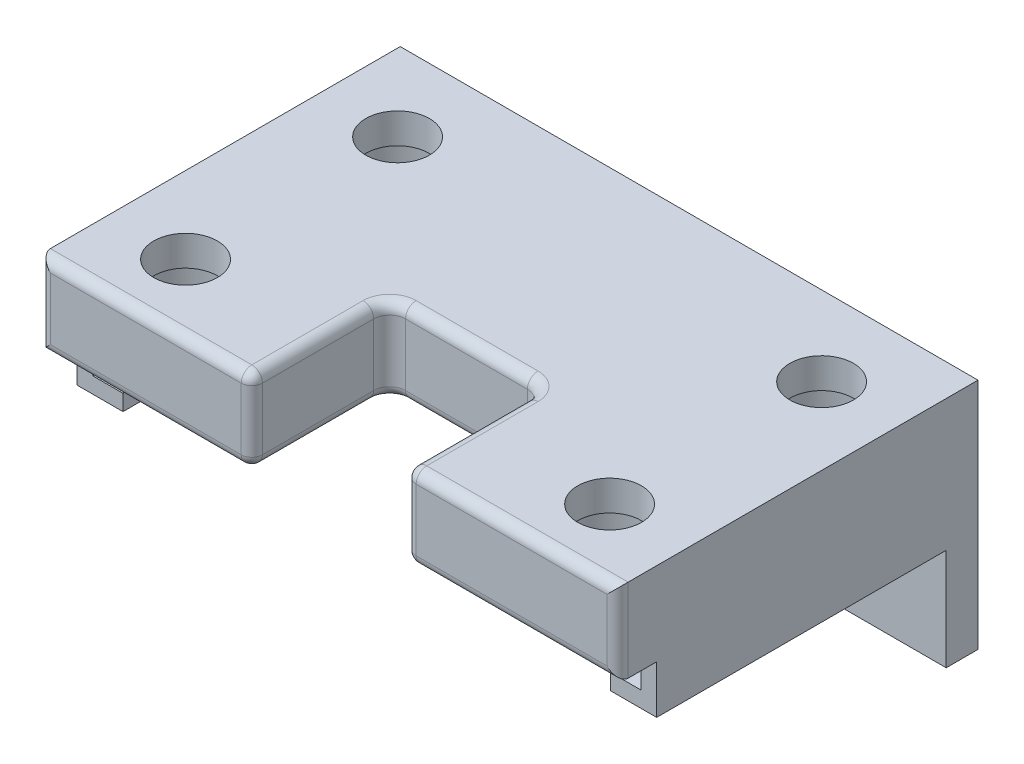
ISO-10303-21;
HEADER;
FILE_DESCRIPTION(('STEP AP214'),'2;1');
FILE_NAME('part.step','',(''),(''),'','','');
FILE_SCHEMA(('AUTOMOTIVE_DESIGN { 1 0 10303 214 1 1 1 1 }'));
ENDSEC;
DATA;
#1=APPLICATION_CONTEXT('core data for automotive mechanical design processes');
#2=APPLICATION_PROTOCOL_DEFINITION('international standard','automotive_design',2000,#1);
#3=PRODUCT_CONTEXT('',#1,'mechanical');
#4=PRODUCT('Part','Part','',(#3));
#5=PRODUCT_RELATED_PRODUCT_CATEGORY('part','',(#4));
#6=PRODUCT_DEFINITION_FORMATION('','',#4);
#7=PRODUCT_DEFINITION_CONTEXT('part definition',#1,'design');
#8=PRODUCT_DEFINITION('design','',#6,#7);
#9=PRODUCT_DEFINITION_SHAPE('','',#8);
#10=(LENGTH_UNIT() NAMED_UNIT(*) SI_UNIT(.MILLI.,.METRE.));
#11=(NAMED_UNIT(*) PLANE_ANGLE_UNIT() SI_UNIT($,.RADIAN.));
#12=(NAMED_UNIT(*) SI_UNIT($,.STERADIAN.) SOLID_ANGLE_UNIT());
#13=UNCERTAINTY_MEASURE_WITH_UNIT(LENGTH_MEASURE(1.E-05),#10,'distance_accuracy_value','');
#14=(GEOMETRIC_REPRESENTATION_CONTEXT(3) GLOBAL_UNCERTAINTY_ASSIGNED_CONTEXT((#13)) GLOBAL_UNIT_ASSIGNED_CONTEXT((#10,
#11,#12)) REPRESENTATION_CONTEXT('',''));
#15=CARTESIAN_POINT('',(0.,0.,0.));
#16=DIRECTION('',(0.,0.,1.));
#17=DIRECTION('',(1.,0.,0.));
#18=AXIS2_PLACEMENT_3D('',#15,#16,#17);
#19=CARTESIAN_POINT('',(48.65,-1.5,-5.));
#20=DIRECTION('',(1.,0.,0.));
#21=DIRECTION('',(0.,0.,-1.));
#22=AXIS2_PLACEMENT_3D('',#19,#20,#21);
#23=PLANE('',#22);
#24=DIRECTION('',(0.,1.,0.));
#25=VECTOR('',#24,1.);
#26=CARTESIAN_POINT('',(48.65,-1.5,-2.));
#27=LINE('',#26,#25);
#28=CARTESIAN_POINT('',(48.65,0.,-2.));
#29=VERTEX_POINT('',#28);
#30=CARTESIAN_POINT('',(48.65,3.05,-2.));
#31=VERTEX_POINT('',#30);
#32=EDGE_CURVE('E331',#29,#31,#27,.T.);
#33=ORIENTED_EDGE('',*,*,#32,.F.);
#34=DIRECTION('',(0.,0.,-1.));
#35=VECTOR('',#34,1.);
#36=CARTESIAN_POINT('',(48.65,0.,-5.));
#37=LINE('',#36,#35);
#38=CARTESIAN_POINT('',(48.65,0.,25.309371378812));
#39=VERTEX_POINT('',#38);
#40=EDGE_CURVE('E390',#39,#29,#37,.T.);
#41=ORIENTED_EDGE('',*,*,#40,.F.);
#42=DIRECTION('',(0.,1.,0.));
#43=VECTOR('',#42,1.);
#44=CARTESIAN_POINT('',(48.65,-1.5,25.309371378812));
#45=LINE('',#44,#43);
#46=CARTESIAN_POINT('',(48.65,3.05,25.309371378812));
#47=VERTEX_POINT('',#46);
#48=EDGE_CURVE('E409',#39,#47,#45,.T.);
#49=ORIENTED_EDGE('',*,*,#48,.T.);
#50=DIRECTION('',(0.,0.,-1.));
#51=VECTOR('',#50,1.);
#52=CARTESIAN_POINT('',(48.65,3.05,-5.));
#53=LINE('',#52,#51);
#54=EDGE_CURVE('E403',#47,#31,#53,.T.);
#55=ORIENTED_EDGE('',*,*,#54,.T.);
#56=EDGE_LOOP('',(#33,#41,#49,#55));
#57=FACE_BOUND('',#56,.T.);
#58=ADVANCED_FACE('F39',(#57),#23,.F.);
#59=CARTESIAN_POINT('',(0.,3.05,0.));
#60=DIRECTION('',(0.,-1.,0.));
#61=DIRECTION('',(0.,0.,-1.));
#62=AXIS2_PLACEMENT_3D('',#59,#60,#61);
#63=PLANE('',#62);
#64=CARTESIAN_POINT('',(2.9,3.05,22.5));
#65=DIRECTION('',(0.,-1.,0.));
#66=DIRECTION('',(0.,0.,-1.));
#67=AXIS2_PLACEMENT_3D('',#64,#65,#66);
#68=CIRCLE('',#67,4.50000000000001);
#69=CARTESIAN_POINT('',(2.9,3.05,18.));
#70=VERTEX_POINT('',#69);
#71=EDGE_CURVE('E366',#70,#70,#68,.T.);
#72=ORIENTED_EDGE('',*,*,#71,.F.);
#73=EDGE_LOOP('',(#72));
#74=FACE_BOUND('',#73,.T.);
#75=CARTESIAN_POINT('',(42.9,3.05,22.5));
#76=DIRECTION('',(0.,-1.,0.));
#77=DIRECTION('',(0.,0.,-1.));
#78=AXIS2_PLACEMENT_3D('',#75,#76,#77);
#79=CIRCLE('',#78,4.50000000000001);
#80=CARTESIAN_POINT('',(42.9,3.05,18.));
#81=VERTEX_POINT('',#80);
#82=EDGE_CURVE('E378',#81,#81,#79,.T.);
#83=ORIENTED_EDGE('',*,*,#82,.F.);
#84=EDGE_LOOP('',(#83));
#85=FACE_BOUND('',#84,.T.);
#86=DIRECTION('',(0.,0.,-1.));
#87=VECTOR('',#86,1.);
#88=CARTESIAN_POINT('',(14.65,3.05,29.));
#89=LINE('',#88,#87);
#90=CARTESIAN_POINT('',(14.65,3.05,17.5));
#91=VERTEX_POINT('',#90);
#92=CARTESIAN_POINT('',(14.65,3.05,28.));
#93=VERTEX_POINT('',#92);
#94=EDGE_CURVE('E535',#91,#93,#89,.F.);
#95=ORIENTED_EDGE('',*,*,#94,.T.);
#96=DIRECTION('',(1.,0.,0.));
#97=VECTOR('',#96,1.);
#98=CARTESIAN_POINT('',(-4.35,3.05,28.));
#99=LINE('',#98,#97);
#100=CARTESIAN_POINT('',(-4.35,3.05,28.));
#101=VERTEX_POINT('',#100);
#102=EDGE_CURVE('E537',#93,#101,#99,.F.);
#103=ORIENTED_EDGE('',*,*,#102,.T.);
#104=DIRECTION('',(0.,0.,-1.));
#105=VECTOR('',#104,1.);
#106=CARTESIAN_POINT('',(-4.35,3.05,30.));
#107=LINE('',#106,#105);
#108=CARTESIAN_POINT('',(-4.35,3.05,25.5));
#109=VERTEX_POINT('',#108);
#110=EDGE_CURVE('E420',#101,#109,#107,.T.);
#111=ORIENTED_EDGE('',*,*,#110,.T.);
#112=DIRECTION('',(1.,0.,0.));
#113=VECTOR('',#112,1.);
#114=CARTESIAN_POINT('',(50.15,3.05,25.5));
#115=LINE('',#114,#113);
#116=CARTESIAN_POINT('',(-2.85,3.05,25.5));
#117=VERTEX_POINT('',#116);
#118=EDGE_CURVE('E417',#109,#117,#115,.T.);
#119=ORIENTED_EDGE('',*,*,#118,.T.);
#120=DIRECTION('',(0.,0.,1.));
#121=VECTOR('',#120,1.);
#122=CARTESIAN_POINT('',(-2.85,3.05,-11.2948391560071));
#123=LINE('',#122,#121);
#124=CARTESIAN_POINT('',(-2.85,3.05,-2.));
#125=VERTEX_POINT('',#124);
#126=EDGE_CURVE('E435',#125,#117,#123,.T.);
#127=ORIENTED_EDGE('',*,*,#126,.F.);
#128=DIRECTION('',(1.,0.,0.));
#129=VECTOR('',#128,1.);
#130=CARTESIAN_POINT('',(0.,3.05,-2.));
#131=LINE('',#130,#129);
#132=CARTESIAN_POINT('',(2.90000000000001,3.05,-2.00000000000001));
#133=VERTEX_POINT('',#132);
#134=EDGE_CURVE('E322',#125,#133,#131,.T.);
#135=ORIENTED_EDGE('',*,*,#134,.T.);
#136=CARTESIAN_POINT('',(2.90000000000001,3.05,2.5));
#137=DIRECTION('',(0.,-1.,0.));
#138=DIRECTION('',(0.,0.,-1.));
#139=AXIS2_PLACEMENT_3D('',#136,#137,#138);
#140=CIRCLE('',#139,4.50000000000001);
#141=EDGE_CURVE('E342',#133,#133,#140,.T.);
#142=ORIENTED_EDGE('',*,*,#141,.F.);
#143=CARTESIAN_POINT('',(42.9,3.05,-2.00000000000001));
#144=VERTEX_POINT('',#143);
#145=EDGE_CURVE('E316',#133,#144,#131,.T.);
#146=ORIENTED_EDGE('',*,*,#145,.T.);
#147=CARTESIAN_POINT('',(42.9,3.05,2.5));
#148=DIRECTION('',(0.,-1.,0.));
#149=DIRECTION('',(0.,0.,-1.));
#150=AXIS2_PLACEMENT_3D('',#147,#148,#149);
#151=CIRCLE('',#150,4.50000000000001);
#152=EDGE_CURVE('E354',#144,#144,#151,.T.);
#153=ORIENTED_EDGE('',*,*,#152,.F.);
#154=EDGE_CURVE('E323',#144,#31,#131,.T.);
#155=ORIENTED_EDGE('',*,*,#154,.T.);
#156=ORIENTED_EDGE('',*,*,#54,.F.);
#157=DIRECTION('',(-1.,0.,0.));
#158=VECTOR('',#157,1.);
#159=CARTESIAN_POINT('',(48.65,3.05,25.309371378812));
#160=LINE('',#159,#158);
#161=CARTESIAN_POINT('',(50.15,3.05,25.309371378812));
#162=VERTEX_POINT('',#161);
#163=EDGE_CURVE('E406',#162,#47,#160,.T.);
#164=ORIENTED_EDGE('',*,*,#163,.F.);
#165=DIRECTION('',(0.,0.,1.));
#166=VECTOR('',#165,1.);
#167=CARTESIAN_POINT('',(50.15,3.05,-5.));
#168=LINE('',#167,#166);
#169=CARTESIAN_POINT('',(50.15,3.05,28.));
#170=VERTEX_POINT('',#169);
#171=EDGE_CURVE('E437',#162,#170,#168,.T.);
#172=ORIENTED_EDGE('',*,*,#171,.T.);
#173=DIRECTION('',(1.,0.,0.));
#174=VECTOR('',#173,1.);
#175=CARTESIAN_POINT('',(30.15,3.05,28.));
#176=LINE('',#175,#174);
#177=CARTESIAN_POINT('',(31.15,3.05,28.));
#178=VERTEX_POINT('',#177);
#179=EDGE_CURVE('E525',#170,#178,#176,.F.);
#180=ORIENTED_EDGE('',*,*,#179,.T.);
#181=DIRECTION('',(0.,0.,1.));
#182=VECTOR('',#181,1.);
#183=CARTESIAN_POINT('',(31.15,3.05,17.5));
#184=LINE('',#183,#182);
#185=CARTESIAN_POINT('',(31.15,3.05,17.5));
#186=VERTEX_POINT('',#185);
#187=EDGE_CURVE('E527',#178,#186,#184,.F.);
#188=ORIENTED_EDGE('',*,*,#187,.T.);
#189=CARTESIAN_POINT('',(28.65,3.05,17.5));
#190=DIRECTION('',(0.,-1.,0.));
#191=DIRECTION('',(0.,0.,-1.));
#192=AXIS2_PLACEMENT_3D('',#189,#190,#191);
#193=CIRCLE('',#192,2.5);
#194=CARTESIAN_POINT('',(28.65,3.05,15.));
#195=VERTEX_POINT('',#194);
#196=EDGE_CURVE('E529',#186,#195,#193,.F.);
#197=ORIENTED_EDGE('',*,*,#196,.T.);
#198=DIRECTION('',(1.,0.,0.));
#199=VECTOR('',#198,1.);
#200=CARTESIAN_POINT('',(17.15,3.05,15.));
#201=LINE('',#200,#199);
#202=CARTESIAN_POINT('',(17.15,3.05,15.));
#203=VERTEX_POINT('',#202);
#204=EDGE_CURVE('E531',#195,#203,#201,.F.);
#205=ORIENTED_EDGE('',*,*,#204,.T.);
#206=CARTESIAN_POINT('',(17.15,3.05,17.5));
#207=DIRECTION('',(0.,-1.,0.));
#208=DIRECTION('',(0.,0.,-1.));
#209=AXIS2_PLACEMENT_3D('',#206,#207,#208);
#210=CIRCLE('',#209,2.5);
#211=EDGE_CURVE('E533',#203,#91,#210,.F.);
#212=ORIENTED_EDGE('',*,*,#211,.T.);
#213=EDGE_LOOP('',(#95,#103,#111,#119,#127,#135,#142,#146,#153,#155,#156,#164,#172,#180,#188,
#197,#205,#212));
#214=FACE_BOUND('',#213,.T.);
#215=ADVANCED_FACE('F648',(#74,#85,#214),#63,.T.);
#216=CARTESIAN_POINT('',(-4.35,-1.5,-11.2948391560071));
#217=DIRECTION('',(0.,-1.,0.));
#218=DIRECTION('',(1.,0.,0.));
#219=AXIS2_PLACEMENT_3D('',#216,#217,#218);
#220=PLANE('',#219);
#221=DIRECTION('',(0.,0.,1.));
#222=VECTOR('',#221,1.);
#223=CARTESIAN_POINT('',(-4.35,-1.5,-11.2948391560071));
#224=LINE('',#223,#222);
#225=CARTESIAN_POINT('',(-4.35,-1.5,-2.));
#226=VERTEX_POINT('',#225);
#227=CARTESIAN_POINT('',(-4.35,-1.5,25.5));
#228=VERTEX_POINT('',#227);
#229=EDGE_CURVE('E426',#226,#228,#224,.T.);
#230=ORIENTED_EDGE('',*,*,#229,.F.);
#231=DIRECTION('',(1.,0.,0.));
#232=VECTOR('',#231,1.);
#233=CARTESIAN_POINT('',(-4.35,-1.5,-2.));
#234=LINE('',#233,#232);
#235=CARTESIAN_POINT('',(0.,-1.5,-2.));
#236=VERTEX_POINT('',#235);
#237=EDGE_CURVE('E340',#226,#236,#234,.T.);
#238=ORIENTED_EDGE('',*,*,#237,.T.);
#239=DIRECTION('',(0.,0.,1.));
#240=VECTOR('',#239,1.);
#241=CARTESIAN_POINT('',(0.,-1.5,-11.2948391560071));
#242=LINE('',#241,#240);
#243=CARTESIAN_POINT('',(0.,-1.5,25.5));
#244=VERTEX_POINT('',#243);
#245=EDGE_CURVE('E442',#236,#244,#242,.T.);
#246=ORIENTED_EDGE('',*,*,#245,.T.);
#247=DIRECTION('',(1.,0.,0.));
#248=VECTOR('',#247,1.);
#249=CARTESIAN_POINT('',(-4.35,-1.5,25.5));
#250=LINE('',#249,#248);
#251=EDGE_CURVE('E422',#228,#244,#250,.T.);
#252=ORIENTED_EDGE('',*,*,#251,.F.);
#253=EDGE_LOOP('',(#230,#238,#246,#252));
#254=FACE_BOUND('',#253,.T.);
#255=ADVANCED_FACE('F654',(#254),#220,.T.);
#256=CARTESIAN_POINT('',(0.,-1.5,-11.2948391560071));
#257=DIRECTION('',(1.,0.,0.));
#258=DIRECTION('',(0.,1.,0.));
#259=AXIS2_PLACEMENT_3D('',#256,#257,#258);
#260=PLANE('',#259);
#261=ORIENTED_EDGE('',*,*,#245,.F.);
#262=DIRECTION('',(0.,1.,0.));
#263=VECTOR('',#262,1.);
#264=CARTESIAN_POINT('',(0.,-1.5,-2.));
#265=LINE('',#264,#263);
#266=CARTESIAN_POINT('',(0.,0.,-2.));
#267=VERTEX_POINT('',#266);
#268=EDGE_CURVE('E338',#236,#267,#265,.T.);
#269=ORIENTED_EDGE('',*,*,#268,.T.);
#270=DIRECTION('',(0.,0.,1.));
#271=VECTOR('',#270,1.);
#272=CARTESIAN_POINT('',(0.,0.,-11.2948391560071));
#273=LINE('',#272,#271);
#274=CARTESIAN_POINT('',(0.,0.,25.5));
#275=VERTEX_POINT('',#274);
#276=EDGE_CURVE('E440',#267,#275,#273,.T.);
#277=ORIENTED_EDGE('',*,*,#276,.T.);
#278=DIRECTION('',(0.,1.,0.));
#279=VECTOR('',#278,1.);
#280=CARTESIAN_POINT('',(0.,-1.5,25.5));
#281=LINE('',#280,#279);
#282=EDGE_CURVE('E430',#244,#275,#281,.T.);
#283=ORIENTED_EDGE('',*,*,#282,.F.);
#284=EDGE_LOOP('',(#261,#269,#277,#283));
#285=FACE_BOUND('',#284,.T.);
#286=ADVANCED_FACE('F669',(#285),#260,.T.);
#287=CARTESIAN_POINT('',(0.,0.,-11.2948391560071));
#288=DIRECTION('',(0.,1.,0.));
#289=DIRECTION('',(-1.,0.,0.));
#290=AXIS2_PLACEMENT_3D('',#287,#288,#289);
#291=PLANE('',#290);
#292=ORIENTED_EDGE('',*,*,#276,.F.);
#293=DIRECTION('',(-1.,0.,0.));
#294=VECTOR('',#293,1.);
#295=CARTESIAN_POINT('',(0.,0.,-2.));
#296=LINE('',#295,#294);
#297=CARTESIAN_POINT('',(-2.85,0.,-2.));
#298=VERTEX_POINT('',#297);
#299=EDGE_CURVE('E336',#267,#298,#296,.T.);
#300=ORIENTED_EDGE('',*,*,#299,.T.);
#301=DIRECTION('',(0.,0.,1.));
#302=VECTOR('',#301,1.);
#303=CARTESIAN_POINT('',(-2.85,0.,-11.2948391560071));
#304=LINE('',#303,#302);
#305=CARTESIAN_POINT('',(-2.85,0.,25.5));
#306=VERTEX_POINT('',#305);
#307=EDGE_CURVE('E438',#298,#306,#304,.T.);
#308=ORIENTED_EDGE('',*,*,#307,.T.);
#309=DIRECTION('',(-1.,0.,0.));
#310=VECTOR('',#309,1.);
#311=CARTESIAN_POINT('',(0.,0.,25.5));
#312=LINE('',#311,#310);
#313=EDGE_CURVE('E427',#275,#306,#312,.T.);
#314=ORIENTED_EDGE('',*,*,#313,.F.);
#315=EDGE_LOOP('',(#292,#300,#308,#314));
#316=FACE_BOUND('',#315,.T.);
#317=ADVANCED_FACE('F665',(#316),#291,.T.);
#318=CARTESIAN_POINT('',(-2.85,0.,-11.2948391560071));
#319=DIRECTION('',(1.,0.,0.));
#320=DIRECTION('',(0.,0.,-1.));
#321=AXIS2_PLACEMENT_3D('',#318,#319,#320);
#322=PLANE('',#321);
#323=ORIENTED_EDGE('',*,*,#307,.F.);
#324=DIRECTION('',(0.,1.,0.));
#325=VECTOR('',#324,1.);
#326=CARTESIAN_POINT('',(-2.85,0.,-2.));
#327=LINE('',#326,#325);
#328=EDGE_CURVE('E334',#298,#125,#327,.T.);
#329=ORIENTED_EDGE('',*,*,#328,.T.);
#330=ORIENTED_EDGE('',*,*,#126,.T.);
#331=DIRECTION('',(0.,1.,0.));
#332=VECTOR('',#331,1.);
#333=CARTESIAN_POINT('',(-2.85,0.,25.5));
#334=LINE('',#333,#332);
#335=EDGE_CURVE('E423',#306,#117,#334,.T.);
#336=ORIENTED_EDGE('',*,*,#335,.F.);
#337=EDGE_LOOP('',(#323,#329,#330,#336));
#338=FACE_BOUND('',#337,.T.);
#339=ADVANCED_FACE('F661',(#338),#322,.T.);
#340=CARTESIAN_POINT('',(0.,-1.5,0.));
#341=DIRECTION('',(0.,1.,0.));
#342=DIRECTION('',(0.,0.,1.));
#343=AXIS2_PLACEMENT_3D('',#340,#341,#342);
#344=PLANE('',#343);
#345=DIRECTION('',(-1.,0.,0.));
#346=VECTOR('',#345,1.);
#347=CARTESIAN_POINT('',(0.,-1.5,-2.));
#348=LINE('',#347,#346);
#349=CARTESIAN_POINT('',(50.15,-1.5,-2.));
#350=VERTEX_POINT('',#349);
#351=CARTESIAN_POINT('',(45.8,-1.5,-2.));
#352=VERTEX_POINT('',#351);
#353=EDGE_CURVE('E329',#350,#352,#348,.T.);
#354=ORIENTED_EDGE('',*,*,#353,.F.);
#355=DIRECTION('',(0.,0.,1.));
#356=VECTOR('',#355,1.);
#357=CARTESIAN_POINT('',(50.15,-1.5,25.309371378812));
#358=LINE('',#357,#356);
#359=CARTESIAN_POINT('',(50.15,-1.5,25.309371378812));
#360=VERTEX_POINT('',#359);
#361=EDGE_CURVE('E275',#350,#360,#358,.T.);
#362=ORIENTED_EDGE('',*,*,#361,.T.);
#363=DIRECTION('',(-1.,0.,0.));
#364=VECTOR('',#363,1.);
#365=CARTESIAN_POINT('',(48.65,-1.5,25.309371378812));
#366=LINE('',#365,#364);
#367=CARTESIAN_POINT('',(45.8,-1.5,25.309371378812));
#368=VERTEX_POINT('',#367);
#369=EDGE_CURVE('E405',#360,#368,#366,.T.);
#370=ORIENTED_EDGE('',*,*,#369,.T.);
#371=DIRECTION('',(0.,0.,1.));
#372=VECTOR('',#371,1.);
#373=CARTESIAN_POINT('',(45.8,-1.5,25.309371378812));
#374=LINE('',#373,#372);
#375=EDGE_CURVE('E397',#352,#368,#374,.T.);
#376=ORIENTED_EDGE('',*,*,#375,.F.);
#377=EDGE_LOOP('',(#354,#362,#370,#376));
#378=FACE_BOUND('',#377,.T.);
#379=ADVANCED_FACE('F664',(#378),#344,.F.);
#380=CARTESIAN_POINT('',(45.8,0.,-5.));
#381=DIRECTION('',(0.,-1.,0.));
#382=DIRECTION('',(0.,0.,-1.));
#383=AXIS2_PLACEMENT_3D('',#380,#381,#382);
#384=PLANE('',#383);
#385=DIRECTION('',(1.,0.,0.));
#386=VECTOR('',#385,1.);
#387=CARTESIAN_POINT('',(45.8,0.,-2.));
#388=LINE('',#387,#386);
#389=CARTESIAN_POINT('',(45.8,0.,-2.));
#390=VERTEX_POINT('',#389);
#391=EDGE_CURVE('E326',#390,#29,#388,.T.);
#392=ORIENTED_EDGE('',*,*,#391,.F.);
#393=DIRECTION('',(0.,0.,-1.));
#394=VECTOR('',#393,1.);
#395=CARTESIAN_POINT('',(45.8,0.,-5.));
#396=LINE('',#395,#394);
#397=CARTESIAN_POINT('',(45.8,0.,25.309371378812));
#398=VERTEX_POINT('',#397);
#399=EDGE_CURVE('E394',#398,#390,#396,.T.);
#400=ORIENTED_EDGE('',*,*,#399,.F.);
#401=DIRECTION('',(1.,0.,0.));
#402=VECTOR('',#401,1.);
#403=CARTESIAN_POINT('',(45.8,0.,25.309371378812));
#404=LINE('',#403,#402);
#405=EDGE_CURVE('E399',#398,#39,#404,.T.);
#406=ORIENTED_EDGE('',*,*,#405,.T.);
#407=ORIENTED_EDGE('',*,*,#40,.T.);
#408=EDGE_LOOP('',(#392,#400,#406,#407));
#409=FACE_BOUND('',#408,.T.);
#410=ADVANCED_FACE('F898',(#409),#384,.F.);
#411=CARTESIAN_POINT('',(45.8,0.,0.));
#412=DIRECTION('',(1.,0.,0.));
#413=DIRECTION('',(0.,0.,-1.));
#414=AXIS2_PLACEMENT_3D('',#411,#412,#413);
#415=PLANE('',#414);
#416=DIRECTION('',(0.,1.,0.));
#417=VECTOR('',#416,1.);
#418=CARTESIAN_POINT('',(45.8,0.,-2.));
#419=LINE('',#418,#417);
#420=EDGE_CURVE('E321',#352,#390,#419,.T.);
#421=ORIENTED_EDGE('',*,*,#420,.F.);
#422=ORIENTED_EDGE('',*,*,#375,.T.);
#423=DIRECTION('',(0.,1.,0.));
#424=VECTOR('',#423,1.);
#425=CARTESIAN_POINT('',(45.8,0.,25.309371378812));
#426=LINE('',#425,#424);
#427=EDGE_CURVE('E391',#368,#398,#426,.T.);
#428=ORIENTED_EDGE('',*,*,#427,.T.);
#429=ORIENTED_EDGE('',*,*,#399,.T.);
#430=EDGE_LOOP('',(#421,#422,#428,#429));
#431=FACE_BOUND('',#430,.T.);
#432=ADVANCED_FACE('F695',(#431),#415,.F.);
#433=CARTESIAN_POINT('',(50.15,10.9,-5.));
#434=DIRECTION('',(1.,0.,0.));
#435=DIRECTION('',(0.,0.,-1.));
#436=AXIS2_PLACEMENT_3D('',#433,#434,#435);
#437=PLANE('',#436);
#438=DIRECTION('',(0.,0.,1.));
#439=VECTOR('',#438,1.);
#440=CARTESIAN_POINT('',(50.15,10.9,-5.));
#441=LINE('',#440,#439);
#442=CARTESIAN_POINT('',(50.15,10.9,-5.));
#443=VERTEX_POINT('',#442);
#444=CARTESIAN_POINT('',(50.15,10.9,28.));
#445=VERTEX_POINT('',#444);
#446=EDGE_CURVE('E445',#443,#445,#441,.T.);
#447=ORIENTED_EDGE('',*,*,#446,.T.);
#448=DIRECTION('',(0.,1.,0.));
#449=VECTOR('',#448,1.);
#450=CARTESIAN_POINT('',(50.15,3.05,28.));
#451=LINE('',#450,#449);
#452=EDGE_CURVE('E11',#445,#170,#451,.F.);
#453=ORIENTED_EDGE('',*,*,#452,.T.);
#454=ORIENTED_EDGE('',*,*,#171,.F.);
#455=DIRECTION('',(0.,1.,0.));
#456=VECTOR('',#455,1.);
#457=CARTESIAN_POINT('',(50.15,-1.5,25.309371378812));
#458=LINE('',#457,#456);
#459=EDGE_CURVE('E415',#360,#162,#458,.T.);
#460=ORIENTED_EDGE('',*,*,#459,.F.);
#461=ORIENTED_EDGE('',*,*,#361,.F.);
#462=DIRECTION('',(0.,-1.,0.));
#463=VECTOR('',#462,1.);
#464=CARTESIAN_POINT('',(50.15,10.9,-2.));
#465=LINE('',#464,#463);
#466=CARTESIAN_POINT('',(50.15,-11.1,-2.));
#467=VERTEX_POINT('',#466);
#468=EDGE_CURVE('E268',#350,#467,#465,.T.);
#469=ORIENTED_EDGE('',*,*,#468,.T.);
#470=DIRECTION('',(0.,0.,-1.));
#471=VECTOR('',#470,1.);
#472=CARTESIAN_POINT('',(50.15,-11.1,-2.));
#473=LINE('',#472,#471);
#474=CARTESIAN_POINT('',(50.15,-11.1,-5.));
#475=VERTEX_POINT('',#474);
#476=EDGE_CURVE('E272',#467,#475,#473,.T.);
#477=ORIENTED_EDGE('',*,*,#476,.T.);
#478=DIRECTION('',(0.,-1.,0.));
#479=VECTOR('',#478,1.);
#480=CARTESIAN_POINT('',(50.15,10.9,-5.));
#481=LINE('',#480,#479);
#482=EDGE_CURVE('E455',#443,#475,#481,.T.);
#483=ORIENTED_EDGE('',*,*,#482,.F.);
#484=EDGE_LOOP('',(#447,#453,#454,#460,#461,#469,#477,#483));
#485=FACE_BOUND('',#484,.T.);
#486=ADVANCED_FACE('F271',(#485),#437,.T.);
#487=CARTESIAN_POINT('',(-4.35,10.9,-5.));
#488=DIRECTION('',(0.,0.,-1.));
#489=DIRECTION('',(-1.,0.,0.));
#490=AXIS2_PLACEMENT_3D('',#487,#488,#489);
#491=PLANE('',#490);
#492=CARTESIAN_POINT('',(38.4,-2.60000000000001,-5.));
#493=DIRECTION('',(0.,0.,-1.));
#494=DIRECTION('',(-1.,0.,0.));
#495=AXIS2_PLACEMENT_3D('',#492,#493,#494);
#496=CIRCLE('',#495,2.75);
#497=CARTESIAN_POINT('',(35.65,-2.60000000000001,-5.));
#498=VERTEX_POINT('',#497);
#499=EDGE_CURVE('E479',#498,#498,#496,.F.);
#500=ORIENTED_EDGE('',*,*,#499,.T.);
#501=EDGE_LOOP('',(#500));
#502=FACE_BOUND('',#501,.T.);
#503=CARTESIAN_POINT('',(7.4,-2.6,-5.));
#504=DIRECTION('',(0.,0.,-1.));
#505=DIRECTION('',(-1.,0.,0.));
#506=AXIS2_PLACEMENT_3D('',#503,#504,#505);
#507=CIRCLE('',#506,2.75);
#508=CARTESIAN_POINT('',(4.65,-2.6,-5.));
#509=VERTEX_POINT('',#508);
#510=EDGE_CURVE('E476',#509,#509,#507,.F.);
#511=ORIENTED_EDGE('',*,*,#510,.T.);
#512=EDGE_LOOP('',(#511));
#513=FACE_BOUND('',#512,.T.);
#514=ORIENTED_EDGE('',*,*,#482,.T.);
#515=DIRECTION('',(-1.,0.,0.));
#516=VECTOR('',#515,1.);
#517=CARTESIAN_POINT('',(50.15,-11.1,-5.));
#518=LINE('',#517,#516);
#519=CARTESIAN_POINT('',(32.987120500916,-11.1,-5.));
#520=VERTEX_POINT('',#519);
#521=EDGE_CURVE('E286',#475,#520,#518,.T.);
#522=ORIENTED_EDGE('',*,*,#521,.T.);
#523=CARTESIAN_POINT('',(22.9,-17.6,-5.));
#524=DIRECTION('',(0.,0.,1.));
#525=DIRECTION('',(-1.,0.,0.));
#526=AXIS2_PLACEMENT_3D('',#523,#524,#525);
#527=CIRCLE('',#526,12.);
#528=CARTESIAN_POINT('',(12.812879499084,-11.1,-5.));
#529=VERTEX_POINT('',#528);
#530=EDGE_CURVE('E307',#520,#529,#527,.T.);
#531=ORIENTED_EDGE('',*,*,#530,.T.);
#532=DIRECTION('',(-1.,0.,0.));
#533=VECTOR('',#532,1.);
#534=CARTESIAN_POINT('',(12.812879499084,-11.1,-5.));
#535=LINE('',#534,#533);
#536=CARTESIAN_POINT('',(-4.35,-11.1,-5.));
#537=VERTEX_POINT('',#536);
#538=EDGE_CURVE('E280',#529,#537,#535,.T.);
#539=ORIENTED_EDGE('',*,*,#538,.T.);
#540=DIRECTION('',(0.,-1.,0.));
#541=VECTOR('',#540,1.);
#542=CARTESIAN_POINT('',(-4.35,10.9,-5.));
#543=LINE('',#542,#541);
#544=CARTESIAN_POINT('',(-4.35,10.9,-5.));
#545=VERTEX_POINT('',#544);
#546=EDGE_CURVE('E458',#545,#537,#543,.T.);
#547=ORIENTED_EDGE('',*,*,#546,.F.);
#548=DIRECTION('',(1.,0.,0.));
#549=VECTOR('',#548,1.);
#550=CARTESIAN_POINT('',(-4.35,10.9,-5.));
#551=LINE('',#550,#549);
#552=EDGE_CURVE('E449',#545,#443,#551,.T.);
#553=ORIENTED_EDGE('',*,*,#552,.T.);
#554=EDGE_LOOP('',(#514,#522,#531,#539,#547,#553));
#555=FACE_BOUND('',#554,.T.);
#556=ADVANCED_FACE('F682',(#502,#513,#555),#491,.T.);
#557=CARTESIAN_POINT('',(-4.35,10.9,25.5));
#558=DIRECTION('',(-1.,0.,0.));
#559=DIRECTION('',(0.,0.,1.));
#560=AXIS2_PLACEMENT_3D('',#557,#558,#559);
#561=PLANE('',#560);
#562=ORIENTED_EDGE('',*,*,#110,.F.);
#563=DIRECTION('',(0.,1.,0.));
#564=VECTOR('',#563,1.);
#565=CARTESIAN_POINT('',(-4.35,10.9,28.));
#566=LINE('',#565,#564);
#567=CARTESIAN_POINT('',(-4.35,10.9,28.));
#568=VERTEX_POINT('',#567);
#569=EDGE_CURVE('E539',#101,#568,#566,.T.);
#570=ORIENTED_EDGE('',*,*,#569,.T.);
#571=DIRECTION('',(0.,0.,-1.));
#572=VECTOR('',#571,1.);
#573=CARTESIAN_POINT('',(-4.35,10.9,25.5));
#574=LINE('',#573,#572);
#575=EDGE_CURVE('E447',#568,#545,#574,.T.);
#576=ORIENTED_EDGE('',*,*,#575,.T.);
#577=ORIENTED_EDGE('',*,*,#546,.T.);
#578=DIRECTION('',(0.,0.,-1.));
#579=VECTOR('',#578,1.);
#580=CARTESIAN_POINT('',(-4.35,-11.1,-2.));
#581=LINE('',#580,#579);
#582=CARTESIAN_POINT('',(-4.35,-11.1,-2.));
#583=VERTEX_POINT('',#582);
#584=EDGE_CURVE('E313',#583,#537,#581,.T.);
#585=ORIENTED_EDGE('',*,*,#584,.F.);
#586=DIRECTION('',(0.,1.,0.));
#587=VECTOR('',#586,1.);
#588=CARTESIAN_POINT('',(-4.35,10.9,-2.));
#589=LINE('',#588,#587);
#590=EDGE_CURVE('E288',#583,#226,#589,.T.);
#591=ORIENTED_EDGE('',*,*,#590,.T.);
#592=ORIENTED_EDGE('',*,*,#229,.T.);
#593=DIRECTION('',(0.,-1.,0.));
#594=VECTOR('',#593,1.);
#595=CARTESIAN_POINT('',(-4.35,10.9,25.5));
#596=LINE('',#595,#594);
#597=EDGE_CURVE('E452',#109,#228,#596,.T.);
#598=ORIENTED_EDGE('',*,*,#597,.F.);
#599=EDGE_LOOP('',(#562,#570,#576,#577,#585,#591,#592,#598));
#600=FACE_BOUND('',#599,.T.);
#601=ADVANCED_FACE('F685',(#600),#561,.T.);
#602=CARTESIAN_POINT('',(50.15,10.9,25.5));
#603=DIRECTION('',(0.,0.,1.));
#604=DIRECTION('',(1.,0.,0.));
#605=AXIS2_PLACEMENT_3D('',#602,#603,#604);
#606=PLANE('',#605);
#607=ORIENTED_EDGE('',*,*,#118,.F.);
#608=ORIENTED_EDGE('',*,*,#597,.T.);
#609=ORIENTED_EDGE('',*,*,#251,.T.);
#610=ORIENTED_EDGE('',*,*,#282,.T.);
#611=ORIENTED_EDGE('',*,*,#313,.T.);
#612=ORIENTED_EDGE('',*,*,#335,.T.);
#613=EDGE_LOOP('',(#607,#608,#609,#610,#611,#612));
#614=FACE_BOUND('',#613,.T.);
#615=ADVANCED_FACE('F679',(#614),#606,.T.);
#616=CARTESIAN_POINT('',(0.,10.9,0.));
#617=DIRECTION('',(0.,-1.,0.));
#618=DIRECTION('',(0.,0.,-1.));
#619=AXIS2_PLACEMENT_3D('',#616,#617,#618);
#620=PLANE('',#619);
#621=ORIENTED_EDGE('',*,*,#575,.F.);
#622=DIRECTION('',(-1.,0.,0.));
#623=VECTOR('',#622,1.);
#624=CARTESIAN_POINT('',(0.,10.9,28.));
#625=LINE('',#624,#623);
#626=CARTESIAN_POINT('',(14.65,10.9,28.));
#627=VERTEX_POINT('',#626);
#628=EDGE_CURVE('E505',#568,#627,#625,.F.);
#629=ORIENTED_EDGE('',*,*,#628,.T.);
#630=DIRECTION('',(0.,0.,1.));
#631=VECTOR('',#630,1.);
#632=CARTESIAN_POINT('',(14.65,10.9,0.));
#633=LINE('',#632,#631);
#634=CARTESIAN_POINT('',(14.65,10.9,17.5));
#635=VERTEX_POINT('',#634);
#636=EDGE_CURVE('E503',#627,#635,#633,.F.);
#637=ORIENTED_EDGE('',*,*,#636,.T.);
#638=CARTESIAN_POINT('',(17.15,10.9,17.5));
#639=DIRECTION('',(0.,-1.,0.));
#640=DIRECTION('',(0.,0.,-1.));
#641=AXIS2_PLACEMENT_3D('',#638,#639,#640);
#642=CIRCLE('',#641,2.5);
#643=CARTESIAN_POINT('',(17.15,10.9,15.));
#644=VERTEX_POINT('',#643);
#645=EDGE_CURVE('E501',#635,#644,#642,.T.);
#646=ORIENTED_EDGE('',*,*,#645,.T.);
#647=DIRECTION('',(-1.,0.,0.));
#648=VECTOR('',#647,1.);
#649=CARTESIAN_POINT('',(0.,10.9,15.));
#650=LINE('',#649,#648);
#651=CARTESIAN_POINT('',(28.65,10.9,15.));
#652=VERTEX_POINT('',#651);
#653=EDGE_CURVE('E499',#644,#652,#650,.F.);
#654=ORIENTED_EDGE('',*,*,#653,.T.);
#655=CARTESIAN_POINT('',(28.65,10.9,17.5));
#656=DIRECTION('',(0.,-1.,0.));
#657=DIRECTION('',(0.,0.,-1.));
#658=AXIS2_PLACEMENT_3D('',#655,#656,#657);
#659=CIRCLE('',#658,2.5);
#660=CARTESIAN_POINT('',(31.15,10.9,17.5));
#661=VERTEX_POINT('',#660);
#662=EDGE_CURVE('E497',#652,#661,#659,.T.);
#663=ORIENTED_EDGE('',*,*,#662,.T.);
#664=DIRECTION('',(0.,0.,-1.));
#665=VECTOR('',#664,1.);
#666=CARTESIAN_POINT('',(31.15,10.9,0.));
#667=LINE('',#666,#665);
#668=CARTESIAN_POINT('',(31.15,10.9,28.));
#669=VERTEX_POINT('',#668);
#670=EDGE_CURVE('E494',#661,#669,#667,.F.);
#671=ORIENTED_EDGE('',*,*,#670,.T.);
#672=DIRECTION('',(-1.,0.,0.));
#673=VECTOR('',#672,1.);
#674=CARTESIAN_POINT('',(0.,10.9,28.));
#675=LINE('',#674,#673);
#676=EDGE_CURVE('E492',#669,#445,#675,.F.);
#677=ORIENTED_EDGE('',*,*,#676,.T.);
#678=ORIENTED_EDGE('',*,*,#446,.F.);
#679=ORIENTED_EDGE('',*,*,#552,.F.);
#680=EDGE_LOOP('',(#621,#629,#637,#646,#654,#663,#671,#677,#678,#679));
#681=FACE_BOUND('',#680,.T.);
#682=CARTESIAN_POINT('',(42.9,10.9,22.5));
#683=DIRECTION('',(0.,-1.,0.));
#684=DIRECTION('',(0.,0.,-1.));
#685=AXIS2_PLACEMENT_3D('',#682,#683,#684);
#686=CIRCLE('',#685,3.00000000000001);
#687=CARTESIAN_POINT('',(42.9,10.9,19.5));
#688=VERTEX_POINT('',#687);
#689=EDGE_CURVE('E387',#688,#688,#686,.T.);
#690=ORIENTED_EDGE('',*,*,#689,.T.);
#691=EDGE_LOOP('',(#690));
#692=FACE_BOUND('',#691,.T.);
#693=CARTESIAN_POINT('',(2.9,10.9,22.5));
#694=DIRECTION('',(0.,-1.,0.));
#695=DIRECTION('',(0.,0.,-1.));
#696=AXIS2_PLACEMENT_3D('',#693,#694,#695);
#697=CIRCLE('',#696,3.00000000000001);
#698=CARTESIAN_POINT('',(2.9,10.9,19.5));
#699=VERTEX_POINT('',#698);
#700=EDGE_CURVE('E375',#699,#699,#697,.T.);
#701=ORIENTED_EDGE('',*,*,#700,.T.);
#702=EDGE_LOOP('',(#701));
#703=FACE_BOUND('',#702,.T.);
#704=CARTESIAN_POINT('',(42.9,10.9,2.5));
#705=DIRECTION('',(0.,-1.,0.));
#706=DIRECTION('',(0.,0.,-1.));
#707=AXIS2_PLACEMENT_3D('',#704,#705,#706);
#708=CIRCLE('',#707,3.00000000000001);
#709=CARTESIAN_POINT('',(42.9,10.9,-0.50000000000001));
#710=VERTEX_POINT('',#709);
#711=EDGE_CURVE('E363',#710,#710,#708,.T.);
#712=ORIENTED_EDGE('',*,*,#711,.T.);
#713=EDGE_LOOP('',(#712));
#714=FACE_BOUND('',#713,.T.);
#715=CARTESIAN_POINT('',(2.90000000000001,10.9,2.5));
#716=DIRECTION('',(0.,-1.,0.));
#717=DIRECTION('',(0.,0.,-1.));
#718=AXIS2_PLACEMENT_3D('',#715,#716,#717);
#719=CIRCLE('',#718,3.00000000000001);
#720=CARTESIAN_POINT('',(2.90000000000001,10.9,-0.500000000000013));
#721=VERTEX_POINT('',#720);
#722=EDGE_CURVE('E351',#721,#721,#719,.T.);
#723=ORIENTED_EDGE('',*,*,#722,.T.);
#724=EDGE_LOOP('',(#723));
#725=FACE_BOUND('',#724,.T.);
#726=ADVANCED_FACE('F677',(#681,#692,#703,#714,#725),#620,.F.);
#727=CARTESIAN_POINT('',(48.65,-1.5,25.309371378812));
#728=DIRECTION('',(0.,0.,-1.));
#729=DIRECTION('',(-1.,0.,0.));
#730=AXIS2_PLACEMENT_3D('',#727,#728,#729);
#731=PLANE('',#730);
#732=ORIENTED_EDGE('',*,*,#163,.T.);
#733=ORIENTED_EDGE('',*,*,#48,.F.);
#734=ORIENTED_EDGE('',*,*,#405,.F.);
#735=ORIENTED_EDGE('',*,*,#427,.F.);
#736=ORIENTED_EDGE('',*,*,#369,.F.);
#737=ORIENTED_EDGE('',*,*,#459,.T.);
#738=EDGE_LOOP('',(#732,#733,#734,#735,#736,#737));
#739=FACE_BOUND('',#738,.T.);
#740=ADVANCED_FACE('F659',(#739),#731,.F.);
#741=CARTESIAN_POINT('',(30.15,-1.5,16.));
#742=DIRECTION('',(0.,0.,-1.));
#743=DIRECTION('',(-1.,0.,0.));
#744=AXIS2_PLACEMENT_3D('',#741,#742,#743);
#745=PLANE('',#744);
#746=DIRECTION('',(0.,1.,0.));
#747=VECTOR('',#746,1.);
#748=CARTESIAN_POINT('',(28.65,10.9,16.));
#749=LINE('',#748,#747);
#750=CARTESIAN_POINT('',(28.65,4.05,16.));
#751=VERTEX_POINT('',#750);
#752=CARTESIAN_POINT('',(28.65,9.89999999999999,16.));
#753=VERTEX_POINT('',#752);
#754=EDGE_CURVE('E464',#751,#753,#749,.T.);
#755=ORIENTED_EDGE('',*,*,#754,.T.);
#756=DIRECTION('',(-1.,0.,0.));
#757=VECTOR('',#756,1.);
#758=CARTESIAN_POINT('',(30.15,9.89999999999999,16.));
#759=LINE('',#758,#757);
#760=CARTESIAN_POINT('',(17.15,9.89999999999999,16.));
#761=VERTEX_POINT('',#760);
#762=EDGE_CURVE('E513',#753,#761,#759,.T.);
#763=ORIENTED_EDGE('',*,*,#762,.T.);
#764=DIRECTION('',(0.,1.,0.));
#765=VECTOR('',#764,1.);
#766=CARTESIAN_POINT('',(17.15,3.05,16.));
#767=LINE('',#766,#765);
#768=CARTESIAN_POINT('',(17.15,4.05,16.));
#769=VERTEX_POINT('',#768);
#770=EDGE_CURVE('E467',#761,#769,#767,.F.);
#771=ORIENTED_EDGE('',*,*,#770,.T.);
#772=DIRECTION('',(1.,0.,0.));
#773=VECTOR('',#772,1.);
#774=CARTESIAN_POINT('',(28.65,4.05,16.));
#775=LINE('',#774,#773);
#776=EDGE_CURVE('E511',#769,#751,#775,.T.);
#777=ORIENTED_EDGE('',*,*,#776,.T.);
#778=EDGE_LOOP('',(#755,#763,#771,#777));
#779=FACE_BOUND('',#778,.T.);
#780=ADVANCED_FACE('F882',(#779),#745,.F.);
#781=CARTESIAN_POINT('',(30.15,-1.5,29.));
#782=DIRECTION('',(1.,0.,0.));
#783=DIRECTION('',(0.,0.,-1.));
#784=AXIS2_PLACEMENT_3D('',#781,#782,#783);
#785=PLANE('',#784);
#786=DIRECTION('',(0.,1.,0.));
#787=VECTOR('',#786,1.);
#788=CARTESIAN_POINT('',(30.15,-1.5,28.));
#789=LINE('',#788,#787);
#790=CARTESIAN_POINT('',(30.15,4.05,28.));
#791=VERTEX_POINT('',#790);
#792=CARTESIAN_POINT('',(30.15,9.89999999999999,28.));
#793=VERTEX_POINT('',#792);
#794=EDGE_CURVE('E485',#791,#793,#789,.T.);
#795=ORIENTED_EDGE('',*,*,#794,.T.);
#796=DIRECTION('',(0.,0.,-1.));
#797=VECTOR('',#796,1.);
#798=CARTESIAN_POINT('',(30.15,9.89999999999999,29.));
#799=LINE('',#798,#797);
#800=CARTESIAN_POINT('',(30.15,9.89999999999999,17.5));
#801=VERTEX_POINT('',#800);
#802=EDGE_CURVE('E489',#793,#801,#799,.T.);
#803=ORIENTED_EDGE('',*,*,#802,.T.);
#804=DIRECTION('',(0.,1.,0.));
#805=VECTOR('',#804,1.);
#806=CARTESIAN_POINT('',(30.15,3.05,17.5));
#807=LINE('',#806,#805);
#808=CARTESIAN_POINT('',(30.15,4.05,17.5));
#809=VERTEX_POINT('',#808);
#810=EDGE_CURVE('E470',#801,#809,#807,.F.);
#811=ORIENTED_EDGE('',*,*,#810,.T.);
#812=DIRECTION('',(0.,0.,1.));
#813=VECTOR('',#812,1.);
#814=CARTESIAN_POINT('',(30.15,4.05,29.));
#815=LINE('',#814,#813);
#816=EDGE_CURVE('E487',#809,#791,#815,.T.);
#817=ORIENTED_EDGE('',*,*,#816,.T.);
#818=EDGE_LOOP('',(#795,#803,#811,#817));
#819=FACE_BOUND('',#818,.T.);
#820=ADVANCED_FACE('F878',(#819),#785,.F.);
#821=CARTESIAN_POINT('',(50.15,-1.5,29.));
#822=DIRECTION('',(0.,0.,-1.));
#823=DIRECTION('',(-1.,0.,0.));
#824=AXIS2_PLACEMENT_3D('',#821,#822,#823);
#825=PLANE('',#824);
#826=DIRECTION('',(-1.,0.,0.));
#827=VECTOR('',#826,1.);
#828=CARTESIAN_POINT('',(50.15,9.89999999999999,29.));
#829=LINE('',#828,#827);
#830=CARTESIAN_POINT('',(49.15,9.89999999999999,29.));
#831=VERTEX_POINT('',#830);
#832=CARTESIAN_POINT('',(31.15,9.89999999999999,29.));
#833=VERTEX_POINT('',#832);
#834=EDGE_CURVE('E56',#831,#833,#829,.T.);
#835=ORIENTED_EDGE('',*,*,#834,.T.);
#836=DIRECTION('',(0.,1.,0.));
#837=VECTOR('',#836,1.);
#838=CARTESIAN_POINT('',(31.15,-1.5,29.));
#839=LINE('',#838,#837);
#840=CARTESIAN_POINT('',(31.15,4.05,29.));
#841=VERTEX_POINT('',#840);
#842=EDGE_CURVE('E48',#833,#841,#839,.F.);
#843=ORIENTED_EDGE('',*,*,#842,.T.);
#844=DIRECTION('',(1.,0.,0.));
#845=VECTOR('',#844,1.);
#846=CARTESIAN_POINT('',(50.15,4.05,29.));
#847=LINE('',#846,#845);
#848=CARTESIAN_POINT('',(49.15,4.05,29.));
#849=VERTEX_POINT('',#848);
#850=EDGE_CURVE('E550',#841,#849,#847,.T.);
#851=ORIENTED_EDGE('',*,*,#850,.T.);
#852=DIRECTION('',(0.,1.,0.));
#853=VECTOR('',#852,1.);
#854=CARTESIAN_POINT('',(49.15,10.9,29.));
#855=LINE('',#854,#853);
#856=EDGE_CURVE('E61',#849,#831,#855,.T.);
#857=ORIENTED_EDGE('',*,*,#856,.T.);
#858=EDGE_LOOP('',(#835,#843,#851,#857));
#859=FACE_BOUND('',#858,.T.);
#860=ADVANCED_FACE('F881',(#859),#825,.F.);
#861=CARTESIAN_POINT('',(15.65,-1.5,29.));
#862=DIRECTION('',(0.,0.,-1.));
#863=DIRECTION('',(-1.,0.,0.));
#864=AXIS2_PLACEMENT_3D('',#861,#862,#863);
#865=PLANE('',#864);
#866=DIRECTION('',(-1.,0.,0.));
#867=VECTOR('',#866,1.);
#868=CARTESIAN_POINT('',(15.65,9.89999999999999,29.));
#869=LINE('',#868,#867);
#870=CARTESIAN_POINT('',(14.65,9.89999999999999,29.));
#871=VERTEX_POINT('',#870);
#872=CARTESIAN_POINT('',(-3.35,9.89999999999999,29.));
#873=VERTEX_POINT('',#872);
#874=EDGE_CURVE('E541',#871,#873,#869,.T.);
#875=ORIENTED_EDGE('',*,*,#874,.T.);
#876=DIRECTION('',(0.,1.,0.));
#877=VECTOR('',#876,1.);
#878=CARTESIAN_POINT('',(-3.35,3.05,29.));
#879=LINE('',#878,#877);
#880=CARTESIAN_POINT('',(-3.35,4.05,29.));
#881=VERTEX_POINT('',#880);
#882=EDGE_CURVE('E547',#873,#881,#879,.F.);
#883=ORIENTED_EDGE('',*,*,#882,.T.);
#884=DIRECTION('',(1.,0.,0.));
#885=VECTOR('',#884,1.);
#886=CARTESIAN_POINT('',(15.65,4.05,29.));
#887=LINE('',#886,#885);
#888=CARTESIAN_POINT('',(14.65,4.05,29.));
#889=VERTEX_POINT('',#888);
#890=EDGE_CURVE('E545',#881,#889,#887,.T.);
#891=ORIENTED_EDGE('',*,*,#890,.T.);
#892=DIRECTION('',(0.,1.,0.));
#893=VECTOR('',#892,1.);
#894=CARTESIAN_POINT('',(14.65,-1.5,29.));
#895=LINE('',#894,#893);
#896=EDGE_CURVE('E543',#889,#871,#895,.T.);
#897=ORIENTED_EDGE('',*,*,#896,.T.);
#898=EDGE_LOOP('',(#875,#883,#891,#897));
#899=FACE_BOUND('',#898,.T.);
#900=ADVANCED_FACE('F886',(#899),#865,.F.);
#901=CARTESIAN_POINT('',(15.65,-1.5,16.));
#902=DIRECTION('',(-1.,0.,0.));
#903=DIRECTION('',(0.,0.,1.));
#904=AXIS2_PLACEMENT_3D('',#901,#902,#903);
#905=PLANE('',#904);
#906=DIRECTION('',(0.,1.,0.));
#907=VECTOR('',#906,1.);
#908=CARTESIAN_POINT('',(15.65,-1.5,28.));
#909=LINE('',#908,#907);
#910=CARTESIAN_POINT('',(15.65,9.89999999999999,28.));
#911=VERTEX_POINT('',#910);
#912=CARTESIAN_POINT('',(15.65,4.05,28.));
#913=VERTEX_POINT('',#912);
#914=EDGE_CURVE('E521',#911,#913,#909,.F.);
#915=ORIENTED_EDGE('',*,*,#914,.T.);
#916=DIRECTION('',(0.,0.,-1.));
#917=VECTOR('',#916,1.);
#918=CARTESIAN_POINT('',(15.65,4.05,17.5));
#919=LINE('',#918,#917);
#920=CARTESIAN_POINT('',(15.65,4.05,17.5));
#921=VERTEX_POINT('',#920);
#922=EDGE_CURVE('E523',#913,#921,#919,.T.);
#923=ORIENTED_EDGE('',*,*,#922,.T.);
#924=DIRECTION('',(0.,1.,0.));
#925=VECTOR('',#924,1.);
#926=CARTESIAN_POINT('',(15.65,10.9,17.5));
#927=LINE('',#926,#925);
#928=CARTESIAN_POINT('',(15.65,9.89999999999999,17.5));
#929=VERTEX_POINT('',#928);
#930=EDGE_CURVE('E457',#921,#929,#927,.T.);
#931=ORIENTED_EDGE('',*,*,#930,.T.);
#932=DIRECTION('',(0.,0.,1.));
#933=VECTOR('',#932,1.);
#934=CARTESIAN_POINT('',(15.65,9.89999999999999,16.));
#935=LINE('',#934,#933);
#936=EDGE_CURVE('E519',#929,#911,#935,.T.);
#937=ORIENTED_EDGE('',*,*,#936,.T.);
#938=EDGE_LOOP('',(#915,#923,#931,#937));
#939=FACE_BOUND('',#938,.T.);
#940=ADVANCED_FACE('F876',(#939),#905,.F.);
#941=CARTESIAN_POINT('',(42.9,3.05,22.5));
#942=DIRECTION('',(0.,-1.,0.));
#943=DIRECTION('',(0.,0.,-1.));
#944=AXIS2_PLACEMENT_3D('',#941,#942,#943);
#945=CYLINDRICAL_SURFACE('',#944,3.00000000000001);
#946=ORIENTED_EDGE('',*,*,#689,.F.);
#947=EDGE_LOOP('',(#946));
#948=FACE_BOUND('',#947,.T.);
#949=CARTESIAN_POINT('',(42.9,8.05,22.5));
#950=DIRECTION('',(0.,-1.,0.));
#951=DIRECTION('',(0.,0.,-1.));
#952=AXIS2_PLACEMENT_3D('',#949,#950,#951);
#953=CIRCLE('',#952,3.00000000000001);
#954=CARTESIAN_POINT('',(42.9,8.05,19.5));
#955=VERTEX_POINT('',#954);
#956=EDGE_CURVE('E384',#955,#955,#953,.T.);
#957=ORIENTED_EDGE('',*,*,#956,.T.);
#958=EDGE_LOOP('',(#957));
#959=FACE_BOUND('',#958,.T.);
#960=ADVANCED_FACE('F872',(#948,#959),#945,.F.);
#961=CARTESIAN_POINT('',(45.9,8.05,22.5));
#962=DIRECTION('',(0.,1.,0.));
#963=DIRECTION('',(0.,0.,1.));
#964=AXIS2_PLACEMENT_3D('',#961,#962,#963);
#965=PLANE('',#964);
#966=ORIENTED_EDGE('',*,*,#956,.F.);
#967=EDGE_LOOP('',(#966));
#968=FACE_BOUND('',#967,.T.);
#969=CARTESIAN_POINT('',(42.9,8.05,22.5));
#970=DIRECTION('',(0.,-1.,0.));
#971=DIRECTION('',(0.,0.,-1.));
#972=AXIS2_PLACEMENT_3D('',#969,#970,#971);
#973=CIRCLE('',#972,4.50000000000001);
#974=CARTESIAN_POINT('',(42.9,8.05,18.));
#975=VERTEX_POINT('',#974);
#976=EDGE_CURVE('E381',#975,#975,#973,.T.);
#977=ORIENTED_EDGE('',*,*,#976,.T.);
#978=EDGE_LOOP('',(#977));
#979=FACE_BOUND('',#978,.T.);
#980=ADVANCED_FACE('F868',(#968,#979),#965,.F.);
#981=CARTESIAN_POINT('',(42.9,3.05,22.5));
#982=DIRECTION('',(0.,-1.,0.));
#983=DIRECTION('',(0.,0.,-1.));
#984=AXIS2_PLACEMENT_3D('',#981,#982,#983);
#985=CYLINDRICAL_SURFACE('',#984,4.50000000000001);
#986=ORIENTED_EDGE('',*,*,#976,.F.);
#987=EDGE_LOOP('',(#986));
#988=FACE_BOUND('',#987,.T.);
#989=ORIENTED_EDGE('',*,*,#82,.T.);
#990=EDGE_LOOP('',(#989));
#991=FACE_BOUND('',#990,.T.);
#992=ADVANCED_FACE('F864',(#988,#991),#985,.F.);
#993=CARTESIAN_POINT('',(2.9,3.05,22.5));
#994=DIRECTION('',(0.,-1.,0.));
#995=DIRECTION('',(0.,0.,-1.));
#996=AXIS2_PLACEMENT_3D('',#993,#994,#995);
#997=CYLINDRICAL_SURFACE('',#996,3.00000000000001);
#998=ORIENTED_EDGE('',*,*,#700,.F.);
#999=EDGE_LOOP('',(#998));
#1000=FACE_BOUND('',#999,.T.);
#1001=CARTESIAN_POINT('',(2.9,8.05,22.5));
#1002=DIRECTION('',(0.,-1.,0.));
#1003=DIRECTION('',(0.,0.,-1.));
#1004=AXIS2_PLACEMENT_3D('',#1001,#1002,#1003);
#1005=CIRCLE('',#1004,3.00000000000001);
#1006=CARTESIAN_POINT('',(2.9,8.05,19.5));
#1007=VERTEX_POINT('',#1006);
#1008=EDGE_CURVE('E372',#1007,#1007,#1005,.T.);
#1009=ORIENTED_EDGE('',*,*,#1008,.T.);
#1010=EDGE_LOOP('',(#1009));
#1011=FACE_BOUND('',#1010,.T.);
#1012=ADVANCED_FACE('F860',(#1000,#1011),#997,.F.);
#1013=CARTESIAN_POINT('',(5.90000000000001,8.05,22.5));
#1014=DIRECTION('',(0.,1.,0.));
#1015=DIRECTION('',(0.,0.,1.));
#1016=AXIS2_PLACEMENT_3D('',#1013,#1014,#1015);
#1017=PLANE('',#1016);
#1018=ORIENTED_EDGE('',*,*,#1008,.F.);
#1019=EDGE_LOOP('',(#1018));
#1020=FACE_BOUND('',#1019,.T.);
#1021=CARTESIAN_POINT('',(2.9,8.05,22.5));
#1022=DIRECTION('',(0.,-1.,0.));
#1023=DIRECTION('',(0.,0.,-1.));
#1024=AXIS2_PLACEMENT_3D('',#1021,#1022,#1023);
#1025=CIRCLE('',#1024,4.50000000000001);
#1026=CARTESIAN_POINT('',(2.9,8.05,18.));
#1027=VERTEX_POINT('',#1026);
#1028=EDGE_CURVE('E369',#1027,#1027,#1025,.T.);
#1029=ORIENTED_EDGE('',*,*,#1028,.T.);
#1030=EDGE_LOOP('',(#1029));
#1031=FACE_BOUND('',#1030,.T.);
#1032=ADVANCED_FACE('F856',(#1020,#1031),#1017,.F.);
#1033=CARTESIAN_POINT('',(2.9,3.05,22.5));
#1034=DIRECTION('',(0.,-1.,0.));
#1035=DIRECTION('',(0.,0.,-1.));
#1036=AXIS2_PLACEMENT_3D('',#1033,#1034,#1035);
#1037=CYLINDRICAL_SURFACE('',#1036,4.50000000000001);
#1038=ORIENTED_EDGE('',*,*,#1028,.F.);
#1039=EDGE_LOOP('',(#1038));
#1040=FACE_BOUND('',#1039,.T.);
#1041=ORIENTED_EDGE('',*,*,#71,.T.);
#1042=EDGE_LOOP('',(#1041));
#1043=FACE_BOUND('',#1042,.T.);
#1044=ADVANCED_FACE('F852',(#1040,#1043),#1037,.F.);
#1045=CARTESIAN_POINT('',(42.9,3.05,2.5));
#1046=DIRECTION('',(0.,-1.,0.));
#1047=DIRECTION('',(0.,0.,-1.));
#1048=AXIS2_PLACEMENT_3D('',#1045,#1046,#1047);
#1049=CYLINDRICAL_SURFACE('',#1048,3.00000000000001);
#1050=ORIENTED_EDGE('',*,*,#711,.F.);
#1051=EDGE_LOOP('',(#1050));
#1052=FACE_BOUND('',#1051,.T.);
#1053=CARTESIAN_POINT('',(42.9,8.05,2.5));
#1054=DIRECTION('',(0.,-1.,0.));
#1055=DIRECTION('',(0.,0.,-1.));
#1056=AXIS2_PLACEMENT_3D('',#1053,#1054,#1055);
#1057=CIRCLE('',#1056,3.00000000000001);
#1058=CARTESIAN_POINT('',(42.9,8.05,-0.50000000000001));
#1059=VERTEX_POINT('',#1058);
#1060=EDGE_CURVE('E360',#1059,#1059,#1057,.T.);
#1061=ORIENTED_EDGE('',*,*,#1060,.T.);
#1062=EDGE_LOOP('',(#1061));
#1063=FACE_BOUND('',#1062,.T.);
#1064=ADVANCED_FACE('F848',(#1052,#1063),#1049,.F.);
#1065=CARTESIAN_POINT('',(45.9,8.05,2.5));
#1066=DIRECTION('',(0.,1.,0.));
#1067=DIRECTION('',(0.,0.,1.));
#1068=AXIS2_PLACEMENT_3D('',#1065,#1066,#1067);
#1069=PLANE('',#1068);
#1070=ORIENTED_EDGE('',*,*,#1060,.F.);
#1071=EDGE_LOOP('',(#1070));
#1072=FACE_BOUND('',#1071,.T.);
#1073=CARTESIAN_POINT('',(42.9,8.05,2.5));
#1074=DIRECTION('',(0.,-1.,0.));
#1075=DIRECTION('',(0.,0.,-1.));
#1076=AXIS2_PLACEMENT_3D('',#1073,#1074,#1075);
#1077=CIRCLE('',#1076,4.50000000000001);
#1078=CARTESIAN_POINT('',(42.9,8.05,-2.00000000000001));
#1079=VERTEX_POINT('',#1078);
#1080=EDGE_CURVE('E357',#1079,#1079,#1077,.T.);
#1081=ORIENTED_EDGE('',*,*,#1080,.T.);
#1082=EDGE_LOOP('',(#1081));
#1083=FACE_BOUND('',#1082,.T.);
#1084=ADVANCED_FACE('F844',(#1072,#1083),#1069,.F.);
#1085=CARTESIAN_POINT('',(42.9,3.05,2.5));
#1086=DIRECTION('',(0.,-1.,0.));
#1087=DIRECTION('',(0.,0.,-1.));
#1088=AXIS2_PLACEMENT_3D('',#1085,#1086,#1087);
#1089=CYLINDRICAL_SURFACE('',#1088,4.50000000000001);
#1090=ORIENTED_EDGE('',*,*,#1080,.F.);
#1091=EDGE_LOOP('',(#1090));
#1092=FACE_BOUND('',#1091,.T.);
#1093=ORIENTED_EDGE('',*,*,#152,.T.);
#1094=EDGE_LOOP('',(#1093));
#1095=FACE_BOUND('',#1094,.T.);
#1096=ADVANCED_FACE('F840',(#1092,#1095),#1089,.F.);
#1097=CARTESIAN_POINT('',(2.90000000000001,3.05,2.5));
#1098=DIRECTION('',(0.,-1.,0.));
#1099=DIRECTION('',(0.,0.,-1.));
#1100=AXIS2_PLACEMENT_3D('',#1097,#1098,#1099);
#1101=CYLINDRICAL_SURFACE('',#1100,3.00000000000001);
#1102=ORIENTED_EDGE('',*,*,#722,.F.);
#1103=EDGE_LOOP('',(#1102));
#1104=FACE_BOUND('',#1103,.T.);
#1105=CARTESIAN_POINT('',(2.90000000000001,8.05,2.5));
#1106=DIRECTION('',(0.,-1.,0.));
#1107=DIRECTION('',(0.,0.,-1.));
#1108=AXIS2_PLACEMENT_3D('',#1105,#1106,#1107);
#1109=CIRCLE('',#1108,3.00000000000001);
#1110=CARTESIAN_POINT('',(2.90000000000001,8.05,-0.500000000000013));
#1111=VERTEX_POINT('',#1110);
#1112=EDGE_CURVE('E348',#1111,#1111,#1109,.T.);
#1113=ORIENTED_EDGE('',*,*,#1112,.T.);
#1114=EDGE_LOOP('',(#1113));
#1115=FACE_BOUND('',#1114,.T.);
#1116=ADVANCED_FACE('F836',(#1104,#1115),#1101,.F.);
#1117=CARTESIAN_POINT('',(5.90000000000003,8.05,2.5));
#1118=DIRECTION('',(0.,1.,0.));
#1119=DIRECTION('',(0.,0.,1.));
#1120=AXIS2_PLACEMENT_3D('',#1117,#1118,#1119);
#1121=PLANE('',#1120);
#1122=ORIENTED_EDGE('',*,*,#1112,.F.);
#1123=EDGE_LOOP('',(#1122));
#1124=FACE_BOUND('',#1123,.T.);
#1125=CARTESIAN_POINT('',(2.90000000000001,8.05,2.5));
#1126=DIRECTION('',(0.,-1.,0.));
#1127=DIRECTION('',(0.,0.,-1.));
#1128=AXIS2_PLACEMENT_3D('',#1125,#1126,#1127);
#1129=CIRCLE('',#1128,4.50000000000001);
#1130=CARTESIAN_POINT('',(2.90000000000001,8.05,-2.00000000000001));
#1131=VERTEX_POINT('',#1130);
#1132=EDGE_CURVE('E345',#1131,#1131,#1129,.T.);
#1133=ORIENTED_EDGE('',*,*,#1132,.T.);
#1134=EDGE_LOOP('',(#1133));
#1135=FACE_BOUND('',#1134,.T.);
#1136=ADVANCED_FACE('F832',(#1124,#1135),#1121,.F.);
#1137=CARTESIAN_POINT('',(2.90000000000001,3.05,2.5));
#1138=DIRECTION('',(0.,-1.,0.));
#1139=DIRECTION('',(0.,0.,-1.));
#1140=AXIS2_PLACEMENT_3D('',#1137,#1138,#1139);
#1141=CYLINDRICAL_SURFACE('',#1140,4.50000000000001);
#1142=ORIENTED_EDGE('',*,*,#1132,.F.);
#1143=EDGE_LOOP('',(#1142));
#1144=FACE_BOUND('',#1143,.T.);
#1145=ORIENTED_EDGE('',*,*,#141,.T.);
#1146=EDGE_LOOP('',(#1145));
#1147=FACE_BOUND('',#1146,.T.);
#1148=ADVANCED_FACE('F700',(#1144,#1147),#1141,.F.);
#1149=CARTESIAN_POINT('',(17.15,-1.5,17.5));
#1150=DIRECTION('',(0.,-1.,0.));
#1151=DIRECTION('',(0.,0.,-1.));
#1152=AXIS2_PLACEMENT_3D('',#1149,#1150,#1151);
#1153=CYLINDRICAL_SURFACE('',#1152,1.5);
#1154=ORIENTED_EDGE('',*,*,#770,.F.);
#1155=CARTESIAN_POINT('',(17.15,9.89999999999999,17.5));
#1156=DIRECTION('',(0.,-1.,0.));
#1157=DIRECTION('',(0.,0.,-1.));
#1158=AXIS2_PLACEMENT_3D('',#1155,#1156,#1157);
#1159=CIRCLE('',#1158,1.5);
#1160=EDGE_CURVE('E517',#761,#929,#1159,.F.);
#1161=ORIENTED_EDGE('',*,*,#1160,.T.);
#1162=ORIENTED_EDGE('',*,*,#930,.F.);
#1163=CARTESIAN_POINT('',(17.15,4.05,17.5));
#1164=DIRECTION('',(0.,-1.,0.));
#1165=DIRECTION('',(0.,0.,-1.));
#1166=AXIS2_PLACEMENT_3D('',#1163,#1164,#1165);
#1167=CIRCLE('',#1166,1.5);
#1168=EDGE_CURVE('E515',#921,#769,#1167,.T.);
#1169=ORIENTED_EDGE('',*,*,#1168,.T.);
#1170=EDGE_LOOP('',(#1154,#1161,#1162,#1169));
#1171=FACE_BOUND('',#1170,.T.);
#1172=ADVANCED_FACE('F696',(#1171),#1153,.F.);
#1173=CARTESIAN_POINT('',(28.65,-1.5,17.5));
#1174=DIRECTION('',(0.,-1.,0.));
#1175=DIRECTION('',(0.,0.,-1.));
#1176=AXIS2_PLACEMENT_3D('',#1173,#1174,#1175);
#1177=CYLINDRICAL_SURFACE('',#1176,1.5);
#1178=ORIENTED_EDGE('',*,*,#810,.F.);
#1179=CARTESIAN_POINT('',(28.65,9.89999999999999,17.5));
#1180=DIRECTION('',(0.,-1.,0.));
#1181=DIRECTION('',(0.,0.,-1.));
#1182=AXIS2_PLACEMENT_3D('',#1179,#1180,#1181);
#1183=CIRCLE('',#1182,1.5);
#1184=EDGE_CURVE('E509',#801,#753,#1183,.F.);
#1185=ORIENTED_EDGE('',*,*,#1184,.T.);
#1186=ORIENTED_EDGE('',*,*,#754,.F.);
#1187=CARTESIAN_POINT('',(28.65,4.05,17.5));
#1188=DIRECTION('',(0.,-1.,0.));
#1189=DIRECTION('',(0.,0.,-1.));
#1190=AXIS2_PLACEMENT_3D('',#1187,#1188,#1189);
#1191=CIRCLE('',#1190,1.5);
#1192=EDGE_CURVE('E507',#751,#809,#1191,.T.);
#1193=ORIENTED_EDGE('',*,*,#1192,.T.);
#1194=EDGE_LOOP('',(#1178,#1185,#1186,#1193));
#1195=FACE_BOUND('',#1194,.T.);
#1196=ADVANCED_FACE('F699',(#1195),#1177,.F.);
#1197=CARTESIAN_POINT('',(12.812879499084,-11.1,-2.));
#1198=DIRECTION('',(0.,-1.,0.));
#1199=DIRECTION('',(0.,0.,-1.));
#1200=AXIS2_PLACEMENT_3D('',#1197,#1198,#1199);
#1201=PLANE('',#1200);
#1202=ORIENTED_EDGE('',*,*,#538,.F.);
#1203=DIRECTION('',(0.,0.,-1.));
#1204=VECTOR('',#1203,1.);
#1205=CARTESIAN_POINT('',(12.812879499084,-11.1,-2.));
#1206=LINE('',#1205,#1204);
#1207=CARTESIAN_POINT('',(12.812879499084,-11.1,-2.));
#1208=VERTEX_POINT('',#1207);
#1209=EDGE_CURVE('E317',#1208,#529,#1206,.T.);
#1210=ORIENTED_EDGE('',*,*,#1209,.F.);
#1211=DIRECTION('',(-1.,0.,0.));
#1212=VECTOR('',#1211,1.);
#1213=CARTESIAN_POINT('',(12.812879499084,-11.1,-2.));
#1214=LINE('',#1213,#1212);
#1215=EDGE_CURVE('E298',#1208,#583,#1214,.T.);
#1216=ORIENTED_EDGE('',*,*,#1215,.T.);
#1217=ORIENTED_EDGE('',*,*,#584,.T.);
#1218=EDGE_LOOP('',(#1202,#1210,#1216,#1217));
#1219=FACE_BOUND('',#1218,.T.);
#1220=ADVANCED_FACE('F704',(#1219),#1201,.T.);
#1221=CARTESIAN_POINT('',(22.9,-17.6,-2.));
#1222=DIRECTION('',(0.,0.,-1.));
#1223=DIRECTION('',(-1.,0.,0.));
#1224=AXIS2_PLACEMENT_3D('',#1221,#1222,#1223);
#1225=CYLINDRICAL_SURFACE('',#1224,12.);
#1226=ORIENTED_EDGE('',*,*,#530,.F.);
#1227=DIRECTION('',(0.,0.,-1.));
#1228=VECTOR('',#1227,1.);
#1229=CARTESIAN_POINT('',(32.987120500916,-11.1,-2.));
#1230=LINE('',#1229,#1228);
#1231=CARTESIAN_POINT('',(32.987120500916,-11.1,-2.));
#1232=VERTEX_POINT('',#1231);
#1233=EDGE_CURVE('E287',#1232,#520,#1230,.T.);
#1234=ORIENTED_EDGE('',*,*,#1233,.F.);
#1235=CARTESIAN_POINT('',(22.9,-17.6,-2.));
#1236=DIRECTION('',(0.,0.,1.));
#1237=DIRECTION('',(-1.,0.,0.));
#1238=AXIS2_PLACEMENT_3D('',#1235,#1236,#1237);
#1239=CIRCLE('',#1238,12.);
#1240=EDGE_CURVE('E296',#1232,#1208,#1239,.T.);
#1241=ORIENTED_EDGE('',*,*,#1240,.T.);
#1242=ORIENTED_EDGE('',*,*,#1209,.T.);
#1243=EDGE_LOOP('',(#1226,#1234,#1241,#1242));
#1244=FACE_BOUND('',#1243,.T.);
#1245=ADVANCED_FACE('F820',(#1244),#1225,.F.);
#1246=CARTESIAN_POINT('',(50.15,-11.1,-2.));
#1247=DIRECTION('',(0.,-1.,0.));
#1248=DIRECTION('',(0.,0.,-1.));
#1249=AXIS2_PLACEMENT_3D('',#1246,#1247,#1248);
#1250=PLANE('',#1249);
#1251=ORIENTED_EDGE('',*,*,#521,.F.);
#1252=ORIENTED_EDGE('',*,*,#476,.F.);
#1253=DIRECTION('',(-1.,0.,0.));
#1254=VECTOR('',#1253,1.);
#1255=CARTESIAN_POINT('',(50.15,-11.1,-2.));
#1256=LINE('',#1255,#1254);
#1257=EDGE_CURVE('E279',#467,#1232,#1256,.T.);
#1258=ORIENTED_EDGE('',*,*,#1257,.T.);
#1259=ORIENTED_EDGE('',*,*,#1233,.T.);
#1260=EDGE_LOOP('',(#1251,#1252,#1258,#1259));
#1261=FACE_BOUND('',#1260,.T.);
#1262=ADVANCED_FACE('F284',(#1261),#1250,.T.);
#1263=CARTESIAN_POINT('',(22.9,-17.6,-2.));
#1264=DIRECTION('',(0.,0.,-1.));
#1265=DIRECTION('',(-1.,0.,0.));
#1266=AXIS2_PLACEMENT_3D('',#1263,#1264,#1265);
#1267=PLANE('',#1266);
#1268=ORIENTED_EDGE('',*,*,#134,.F.);
#1269=ORIENTED_EDGE('',*,*,#328,.F.);
#1270=ORIENTED_EDGE('',*,*,#299,.F.);
#1271=ORIENTED_EDGE('',*,*,#268,.F.);
#1272=ORIENTED_EDGE('',*,*,#237,.F.);
#1273=ORIENTED_EDGE('',*,*,#590,.F.);
#1274=ORIENTED_EDGE('',*,*,#1215,.F.);
#1275=ORIENTED_EDGE('',*,*,#1240,.F.);
#1276=ORIENTED_EDGE('',*,*,#1257,.F.);
#1277=ORIENTED_EDGE('',*,*,#468,.F.);
#1278=ORIENTED_EDGE('',*,*,#353,.T.);
#1279=ORIENTED_EDGE('',*,*,#420,.T.);
#1280=ORIENTED_EDGE('',*,*,#391,.T.);
#1281=ORIENTED_EDGE('',*,*,#32,.T.);
#1282=ORIENTED_EDGE('',*,*,#154,.F.);
#1283=ORIENTED_EDGE('',*,*,#145,.F.);
#1284=EDGE_LOOP('',(#1268,#1269,#1270,#1271,#1272,#1273,#1274,#1275,#1276,#1277,#1278,#1279,
#1280,#1281,#1282,#1283));
#1285=FACE_BOUND('',#1284,.T.);
#1286=CARTESIAN_POINT('',(7.4,-2.6,-2.));
#1287=DIRECTION('',(0.,0.,-1.));
#1288=DIRECTION('',(-1.,0.,0.));
#1289=AXIS2_PLACEMENT_3D('',#1286,#1287,#1288);
#1290=CIRCLE('',#1289,1.75);
#1291=CARTESIAN_POINT('',(5.65,-2.6,-2.));
#1292=VERTEX_POINT('',#1291);
#1293=EDGE_CURVE('E622',#1292,#1292,#1290,.T.);
#1294=ORIENTED_EDGE('',*,*,#1293,.T.);
#1295=EDGE_LOOP('',(#1294));
#1296=FACE_BOUND('',#1295,.T.);
#1297=CARTESIAN_POINT('',(38.4,-2.60000000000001,-2.));
#1298=DIRECTION('',(0.,0.,-1.));
#1299=DIRECTION('',(-1.,0.,0.));
#1300=AXIS2_PLACEMENT_3D('',#1297,#1298,#1299);
#1301=CIRCLE('',#1300,1.75);
#1302=CARTESIAN_POINT('',(36.65,-2.60000000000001,-2.));
#1303=VERTEX_POINT('',#1302);
#1304=EDGE_CURVE('E308',#1303,#1303,#1301,.T.);
#1305=ORIENTED_EDGE('',*,*,#1304,.T.);
#1306=EDGE_LOOP('',(#1305));
#1307=FACE_BOUND('',#1306,.T.);
#1308=ADVANCED_FACE('F292',(#1285,#1296,#1307),#1267,.F.);
#1309=CARTESIAN_POINT('',(38.4,-2.60000000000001,-2.));
#1310=DIRECTION('',(0.,0.,-1.));
#1311=DIRECTION('',(-1.,0.,0.));
#1312=AXIS2_PLACEMENT_3D('',#1309,#1310,#1311);
#1313=CYLINDRICAL_SURFACE('',#1312,1.75);
#1314=CARTESIAN_POINT('',(38.4,-2.60000000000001,-4.));
#1315=DIRECTION('',(0.,0.,-1.));
#1316=DIRECTION('',(-1.,0.,0.));
#1317=AXIS2_PLACEMENT_3D('',#1314,#1315,#1316);
#1318=CIRCLE('',#1317,1.75);
#1319=CARTESIAN_POINT('',(36.65,-2.60000000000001,-4.));
#1320=VERTEX_POINT('',#1319);
#1321=EDGE_CURVE('E473',#1320,#1320,#1318,.T.);
#1322=ORIENTED_EDGE('',*,*,#1321,.T.);
#1323=EDGE_LOOP('',(#1322));
#1324=FACE_BOUND('',#1323,.T.);
#1325=ORIENTED_EDGE('',*,*,#1304,.F.);
#1326=EDGE_LOOP('',(#1325));
#1327=FACE_BOUND('',#1326,.T.);
#1328=ADVANCED_FACE('F634',(#1324,#1327),#1313,.F.);
#1329=CARTESIAN_POINT('',(7.4,-2.6,-2.));
#1330=DIRECTION('',(0.,0.,-1.));
#1331=DIRECTION('',(-1.,0.,0.));
#1332=AXIS2_PLACEMENT_3D('',#1329,#1330,#1331);
#1333=CYLINDRICAL_SURFACE('',#1332,1.75);
#1334=CARTESIAN_POINT('',(7.4,-2.6,-4.));
#1335=DIRECTION('',(0.,0.,-1.));
#1336=DIRECTION('',(-1.,0.,0.));
#1337=AXIS2_PLACEMENT_3D('',#1334,#1335,#1336);
#1338=CIRCLE('',#1337,1.75);
#1339=CARTESIAN_POINT('',(5.65,-2.6,-4.));
#1340=VERTEX_POINT('',#1339);
#1341=EDGE_CURVE('E482',#1340,#1340,#1338,.T.);
#1342=ORIENTED_EDGE('',*,*,#1341,.T.);
#1343=EDGE_LOOP('',(#1342));
#1344=FACE_BOUND('',#1343,.T.);
#1345=ORIENTED_EDGE('',*,*,#1293,.F.);
#1346=EDGE_LOOP('',(#1345));
#1347=FACE_BOUND('',#1346,.T.);
#1348=ADVANCED_FACE('F636',(#1344,#1347),#1333,.F.);
#1349=CARTESIAN_POINT('',(38.4,-2.60000000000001,-4.));
#1350=DIRECTION('',(0.,0.,-1.));
#1351=DIRECTION('',(-1.,0.,0.));
#1352=AXIS2_PLACEMENT_3D('',#1349,#1350,#1351);
#1353=CONICAL_SURFACE('',#1352,1.75,0.785398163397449);
#1354=ORIENTED_EDGE('',*,*,#499,.F.);
#1355=EDGE_LOOP('',(#1354));
#1356=FACE_BOUND('',#1355,.T.);
#1357=ORIENTED_EDGE('',*,*,#1321,.F.);
#1358=EDGE_LOOP('',(#1357));
#1359=FACE_BOUND('',#1358,.T.);
#1360=ADVANCED_FACE('F643',(#1356,#1359),#1353,.F.);
#1361=CARTESIAN_POINT('',(7.4,-2.6,-4.));
#1362=DIRECTION('',(0.,0.,-1.));
#1363=DIRECTION('',(-1.,0.,0.));
#1364=AXIS2_PLACEMENT_3D('',#1361,#1362,#1363);
#1365=CONICAL_SURFACE('',#1364,1.75,0.785398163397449);
#1366=ORIENTED_EDGE('',*,*,#510,.F.);
#1367=EDGE_LOOP('',(#1366));
#1368=FACE_BOUND('',#1367,.T.);
#1369=ORIENTED_EDGE('',*,*,#1341,.F.);
#1370=EDGE_LOOP('',(#1369));
#1371=FACE_BOUND('',#1370,.T.);
#1372=ADVANCED_FACE('F708',(#1368,#1371),#1365,.F.);
#1373=CARTESIAN_POINT('',(14.65,4.05,16.));
#1374=DIRECTION('',(0.,0.,1.));
#1375=DIRECTION('',(1.,0.,0.));
#1376=AXIS2_PLACEMENT_3D('',#1373,#1374,#1375);
#1377=CYLINDRICAL_SURFACE('',#1376,1.);
#1378=CARTESIAN_POINT('',(14.65,4.05,28.));
#1379=DIRECTION('',(0.,0.,1.));
#1380=DIRECTION('',(1.,0.,0.));
#1381=AXIS2_PLACEMENT_3D('',#1378,#1379,#1380);
#1382=CIRCLE('',#1381,1.);
#1383=EDGE_CURVE('E616',#93,#913,#1382,.T.);
#1384=ORIENTED_EDGE('',*,*,#1383,.F.);
#1385=ORIENTED_EDGE('',*,*,#94,.F.);
#1386=CARTESIAN_POINT('',(14.65,4.05,17.5));
#1387=DIRECTION('',(0.,0.,-1.));
#1388=DIRECTION('',(-1.,0.,0.));
#1389=AXIS2_PLACEMENT_3D('',#1386,#1387,#1388);
#1390=CIRCLE('',#1389,1.);
#1391=EDGE_CURVE('E43',#921,#91,#1390,.T.);
#1392=ORIENTED_EDGE('',*,*,#1391,.F.);
#1393=ORIENTED_EDGE('',*,*,#922,.F.);
#1394=EDGE_LOOP('',(#1384,#1385,#1392,#1393));
#1395=FACE_BOUND('',#1394,.T.);
#1396=ADVANCED_FACE('F41',(#1395),#1377,.T.);
#1397=CARTESIAN_POINT('',(15.65,4.05,28.));
#1398=DIRECTION('',(-1.,0.,0.));
#1399=DIRECTION('',(0.,0.,1.));
#1400=AXIS2_PLACEMENT_3D('',#1397,#1398,#1399);
#1401=CYLINDRICAL_SURFACE('',#1400,1.);
#1402=CARTESIAN_POINT('',(-3.35,4.05,28.));
#1403=DIRECTION('',(-0.707106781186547,0.707106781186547,0.));
#1404=DIRECTION('',(-0.707106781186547,-0.707106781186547,0.));
#1405=AXIS2_PLACEMENT_3D('',#1402,#1403,#1404);
#1406=ELLIPSE('',#1405,1.41421356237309,1.);
#1407=EDGE_CURVE('E612',#101,#881,#1406,.T.);
#1408=ORIENTED_EDGE('',*,*,#1407,.F.);
#1409=ORIENTED_EDGE('',*,*,#102,.F.);
#1410=CARTESIAN_POINT('',(14.65,4.05,28.));
#1411=DIRECTION('',(1.,0.,0.));
#1412=DIRECTION('',(0.,0.,-1.));
#1413=AXIS2_PLACEMENT_3D('',#1410,#1411,#1412);
#1414=CIRCLE('',#1413,1.);
#1415=EDGE_CURVE('E614',#889,#93,#1414,.T.);
#1416=ORIENTED_EDGE('',*,*,#1415,.F.);
#1417=ORIENTED_EDGE('',*,*,#890,.F.);
#1418=EDGE_LOOP('',(#1408,#1409,#1416,#1417));
#1419=FACE_BOUND('',#1418,.T.);
#1420=ADVANCED_FACE('F790',(#1419),#1401,.T.);
#1421=CARTESIAN_POINT('',(17.15,4.05,17.5));
#1422=DIRECTION('',(0.,-1.,0.));
#1423=DIRECTION('',(0.,0.,-1.));
#1424=AXIS2_PLACEMENT_3D('',#1421,#1422,#1423);
#1425=TOROIDAL_SURFACE('',#1424,2.5,1.);
#1426=ORIENTED_EDGE('',*,*,#1391,.T.);
#1427=ORIENTED_EDGE('',*,*,#211,.F.);
#1428=CARTESIAN_POINT('',(17.15,4.05,15.));
#1429=DIRECTION('',(1.,0.,0.));
#1430=DIRECTION('',(0.,0.,-1.));
#1431=AXIS2_PLACEMENT_3D('',#1428,#1429,#1430);
#1432=CIRCLE('',#1431,1.);
#1433=EDGE_CURVE('E609',#769,#203,#1432,.T.);
#1434=ORIENTED_EDGE('',*,*,#1433,.F.);
#1435=ORIENTED_EDGE('',*,*,#1168,.F.);
#1436=EDGE_LOOP('',(#1426,#1427,#1434,#1435));
#1437=FACE_BOUND('',#1436,.T.);
#1438=ADVANCED_FACE('F788',(#1437),#1425,.T.);
#1439=CARTESIAN_POINT('',(14.65,4.05,28.));
#1440=DIRECTION('',(0.,-1.,0.));
#1441=DIRECTION('',(0.,0.,-1.));
#1442=AXIS2_PLACEMENT_3D('',#1439,#1440,#1441);
#1443=SPHERICAL_SURFACE('',#1442,1.);
#1444=ORIENTED_EDGE('',*,*,#1415,.T.);
#1445=ORIENTED_EDGE('',*,*,#1383,.T.);
#1446=CARTESIAN_POINT('',(14.65,4.05,28.));
#1447=DIRECTION('',(0.,-1.,0.));
#1448=DIRECTION('',(0.,0.,-1.));
#1449=AXIS2_PLACEMENT_3D('',#1446,#1447,#1448);
#1450=CIRCLE('',#1449,1.);
#1451=EDGE_CURVE('E606',#889,#913,#1450,.F.);
#1452=ORIENTED_EDGE('',*,*,#1451,.F.);
#1453=EDGE_LOOP('',(#1444,#1445,#1452));
#1454=FACE_BOUND('',#1453,.T.);
#1455=ADVANCED_FACE('F784',(#1454),#1443,.T.);
#1456=CARTESIAN_POINT('',(-3.35,10.9,28.));
#1457=DIRECTION('',(0.,-1.,0.));
#1458=DIRECTION('',(0.,0.,-1.));
#1459=AXIS2_PLACEMENT_3D('',#1456,#1457,#1458);
#1460=CYLINDRICAL_SURFACE('',#1459,1.);
#1461=ORIENTED_EDGE('',*,*,#1407,.T.);
#1462=ORIENTED_EDGE('',*,*,#882,.F.);
#1463=CARTESIAN_POINT('',(-3.35,9.89999999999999,28.));
#1464=DIRECTION('',(-0.707106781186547,-0.707106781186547,0.));
#1465=DIRECTION('',(-0.707106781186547,0.707106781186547,0.));
#1466=AXIS2_PLACEMENT_3D('',#1463,#1464,#1465);
#1467=ELLIPSE('',#1466,1.41421356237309,1.);
#1468=EDGE_CURVE('E603',#568,#873,#1467,.F.);
#1469=ORIENTED_EDGE('',*,*,#1468,.F.);
#1470=ORIENTED_EDGE('',*,*,#569,.F.);
#1471=EDGE_LOOP('',(#1461,#1462,#1469,#1470));
#1472=FACE_BOUND('',#1471,.T.);
#1473=ADVANCED_FACE('F780',(#1472),#1460,.T.);
#1474=CARTESIAN_POINT('',(30.15,4.05,15.));
#1475=DIRECTION('',(-1.,0.,0.));
#1476=DIRECTION('',(0.,0.,1.));
#1477=AXIS2_PLACEMENT_3D('',#1474,#1475,#1476);
#1478=CYLINDRICAL_SURFACE('',#1477,1.);
#1479=ORIENTED_EDGE('',*,*,#1433,.T.);
#1480=ORIENTED_EDGE('',*,*,#204,.F.);
#1481=CARTESIAN_POINT('',(28.65,4.05,15.));
#1482=DIRECTION('',(1.,0.,0.));
#1483=DIRECTION('',(0.,0.,-1.));
#1484=AXIS2_PLACEMENT_3D('',#1481,#1482,#1483);
#1485=CIRCLE('',#1484,1.);
#1486=EDGE_CURVE('E600',#751,#195,#1485,.T.);
#1487=ORIENTED_EDGE('',*,*,#1486,.F.);
#1488=ORIENTED_EDGE('',*,*,#776,.F.);
#1489=EDGE_LOOP('',(#1479,#1480,#1487,#1488));
#1490=FACE_BOUND('',#1489,.T.);
#1491=ADVANCED_FACE('F776',(#1490),#1478,.T.);
#1492=CARTESIAN_POINT('',(14.65,-1.5,28.));
#1493=DIRECTION('',(0.,1.,0.));
#1494=DIRECTION('',(0.,0.,1.));
#1495=AXIS2_PLACEMENT_3D('',#1492,#1493,#1494);
#1496=CYLINDRICAL_SURFACE('',#1495,1.);
#1497=ORIENTED_EDGE('',*,*,#1451,.T.);
#1498=ORIENTED_EDGE('',*,*,#914,.F.);
#1499=CARTESIAN_POINT('',(14.65,9.89999999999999,28.));
#1500=DIRECTION('',(0.,1.,0.));
#1501=DIRECTION('',(0.,0.,1.));
#1502=AXIS2_PLACEMENT_3D('',#1499,#1500,#1501);
#1503=CIRCLE('',#1502,1.);
#1504=EDGE_CURVE('E597',#871,#911,#1503,.T.);
#1505=ORIENTED_EDGE('',*,*,#1504,.F.);
#1506=ORIENTED_EDGE('',*,*,#896,.F.);
#1507=EDGE_LOOP('',(#1497,#1498,#1505,#1506));
#1508=FACE_BOUND('',#1507,.T.);
#1509=ADVANCED_FACE('F772',(#1508),#1496,.T.);
#1510=CARTESIAN_POINT('',(15.65,9.89999999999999,28.));
#1511=DIRECTION('',(-1.,0.,0.));
#1512=DIRECTION('',(0.,0.,1.));
#1513=AXIS2_PLACEMENT_3D('',#1510,#1511,#1512);
#1514=CYLINDRICAL_SURFACE('',#1513,1.);
#1515=ORIENTED_EDGE('',*,*,#1468,.T.);
#1516=ORIENTED_EDGE('',*,*,#874,.F.);
#1517=CARTESIAN_POINT('',(14.65,9.89999999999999,28.));
#1518=DIRECTION('',(1.,0.,0.));
#1519=DIRECTION('',(0.,0.,-1.));
#1520=AXIS2_PLACEMENT_3D('',#1517,#1518,#1519);
#1521=CIRCLE('',#1520,1.);
#1522=EDGE_CURVE('E594',#627,#871,#1521,.T.);
#1523=ORIENTED_EDGE('',*,*,#1522,.F.);
#1524=ORIENTED_EDGE('',*,*,#628,.F.);
#1525=EDGE_LOOP('',(#1515,#1516,#1523,#1524));
#1526=FACE_BOUND('',#1525,.T.);
#1527=ADVANCED_FACE('F768',(#1526),#1514,.T.);
#1528=CARTESIAN_POINT('',(28.65,4.05,17.5));
#1529=DIRECTION('',(0.,-1.,0.));
#1530=DIRECTION('',(0.,0.,-1.));
#1531=AXIS2_PLACEMENT_3D('',#1528,#1529,#1530);
#1532=TOROIDAL_SURFACE('',#1531,2.5,1.);
#1533=ORIENTED_EDGE('',*,*,#1486,.T.);
#1534=ORIENTED_EDGE('',*,*,#196,.F.);
#1535=CARTESIAN_POINT('',(31.15,4.05,17.5));
#1536=DIRECTION('',(0.,0.,1.));
#1537=DIRECTION('',(1.,0.,0.));
#1538=AXIS2_PLACEMENT_3D('',#1535,#1536,#1537);
#1539=CIRCLE('',#1538,1.);
#1540=EDGE_CURVE('E591',#809,#186,#1539,.T.);
#1541=ORIENTED_EDGE('',*,*,#1540,.F.);
#1542=ORIENTED_EDGE('',*,*,#1192,.F.);
#1543=EDGE_LOOP('',(#1533,#1534,#1541,#1542));
#1544=FACE_BOUND('',#1543,.T.);
#1545=ADVANCED_FACE('F764',(#1544),#1532,.T.);
#1546=CARTESIAN_POINT('',(14.65,9.89999999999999,28.));
#1547=DIRECTION('',(0.,0.,1.));
#1548=DIRECTION('',(1.,0.,0.));
#1549=AXIS2_PLACEMENT_3D('',#1546,#1547,#1548);
#1550=SPHERICAL_SURFACE('',#1549,1.);
#1551=ORIENTED_EDGE('',*,*,#1522,.T.);
#1552=ORIENTED_EDGE('',*,*,#1504,.T.);
#1553=CARTESIAN_POINT('',(14.65,9.89999999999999,28.));
#1554=DIRECTION('',(0.,0.,1.));
#1555=DIRECTION('',(1.,0.,0.));
#1556=AXIS2_PLACEMENT_3D('',#1553,#1554,#1555);
#1557=CIRCLE('',#1556,1.);
#1558=EDGE_CURVE('E588',#627,#911,#1557,.F.);
#1559=ORIENTED_EDGE('',*,*,#1558,.F.);
#1560=EDGE_LOOP('',(#1551,#1552,#1559));
#1561=FACE_BOUND('',#1560,.T.);
#1562=ADVANCED_FACE('F760',(#1561),#1550,.T.);
#1563=CARTESIAN_POINT('',(50.15,4.05,28.));
#1564=DIRECTION('',(-1.,0.,0.));
#1565=DIRECTION('',(0.,0.,1.));
#1566=AXIS2_PLACEMENT_3D('',#1563,#1564,#1565);
#1567=CYLINDRICAL_SURFACE('',#1566,1.);
#1568=CARTESIAN_POINT('',(31.15,4.05,28.));
#1569=DIRECTION('',(-1.,0.,0.));
#1570=DIRECTION('',(0.,0.,1.));
#1571=AXIS2_PLACEMENT_3D('',#1568,#1569,#1570);
#1572=CIRCLE('',#1571,1.);
#1573=EDGE_CURVE('E582',#178,#841,#1572,.T.);
#1574=ORIENTED_EDGE('',*,*,#1573,.F.);
#1575=ORIENTED_EDGE('',*,*,#179,.F.);
#1576=CARTESIAN_POINT('',(49.15,4.05,28.));
#1577=DIRECTION('',(-0.707106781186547,-0.707106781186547,0.));
#1578=DIRECTION('',(-0.707106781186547,0.707106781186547,0.));
#1579=AXIS2_PLACEMENT_3D('',#1576,#1577,#1578);
#1580=ELLIPSE('',#1579,1.41421356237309,1.);
#1581=EDGE_CURVE('E585',#849,#170,#1580,.F.);
#1582=ORIENTED_EDGE('',*,*,#1581,.F.);
#1583=ORIENTED_EDGE('',*,*,#850,.F.);
#1584=EDGE_LOOP('',(#1574,#1575,#1582,#1583));
#1585=FACE_BOUND('',#1584,.T.);
#1586=ADVANCED_FACE('F756',(#1585),#1567,.T.);
#1587=CARTESIAN_POINT('',(31.15,4.05,29.));
#1588=DIRECTION('',(0.,0.,-1.));
#1589=DIRECTION('',(-1.,0.,0.));
#1590=AXIS2_PLACEMENT_3D('',#1587,#1588,#1589);
#1591=CYLINDRICAL_SURFACE('',#1590,1.);
#1592=ORIENTED_EDGE('',*,*,#1540,.T.);
#1593=ORIENTED_EDGE('',*,*,#187,.F.);
#1594=CARTESIAN_POINT('',(31.15,4.05,28.));
#1595=DIRECTION('',(0.,0.,1.));
#1596=DIRECTION('',(1.,0.,0.));
#1597=AXIS2_PLACEMENT_3D('',#1594,#1595,#1596);
#1598=CIRCLE('',#1597,1.);
#1599=EDGE_CURVE('E579',#791,#178,#1598,.T.);
#1600=ORIENTED_EDGE('',*,*,#1599,.F.);
#1601=ORIENTED_EDGE('',*,*,#816,.F.);
#1602=EDGE_LOOP('',(#1592,#1593,#1600,#1601));
#1603=FACE_BOUND('',#1602,.T.);
#1604=ADVANCED_FACE('F752',(#1603),#1591,.T.);
#1605=CARTESIAN_POINT('',(14.65,9.89999999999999,16.));
#1606=DIRECTION('',(0.,0.,1.));
#1607=DIRECTION('',(1.,0.,0.));
#1608=AXIS2_PLACEMENT_3D('',#1605,#1606,#1607);
#1609=CYLINDRICAL_SURFACE('',#1608,1.);
#1610=ORIENTED_EDGE('',*,*,#1558,.T.);
#1611=ORIENTED_EDGE('',*,*,#936,.F.);
#1612=CARTESIAN_POINT('',(14.65,9.89999999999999,17.5));
#1613=DIRECTION('',(0.,0.,-1.));
#1614=DIRECTION('',(-1.,0.,0.));
#1615=AXIS2_PLACEMENT_3D('',#1612,#1613,#1614);
#1616=CIRCLE('',#1615,1.);
#1617=EDGE_CURVE('E576',#635,#929,#1616,.T.);
#1618=ORIENTED_EDGE('',*,*,#1617,.F.);
#1619=ORIENTED_EDGE('',*,*,#636,.F.);
#1620=EDGE_LOOP('',(#1610,#1611,#1618,#1619));
#1621=FACE_BOUND('',#1620,.T.);
#1622=ADVANCED_FACE('F748',(#1621),#1609,.T.);
#1623=CARTESIAN_POINT('',(49.15,-1.5,28.));
#1624=DIRECTION('',(0.,-1.,0.));
#1625=DIRECTION('',(0.,0.,-1.));
#1626=AXIS2_PLACEMENT_3D('',#1623,#1624,#1625);
#1627=CYLINDRICAL_SURFACE('',#1626,1.);
#1628=ORIENTED_EDGE('',*,*,#1581,.T.);
#1629=ORIENTED_EDGE('',*,*,#452,.F.);
#1630=CARTESIAN_POINT('',(49.15,9.89999999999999,28.));
#1631=DIRECTION('',(0.707106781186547,-0.707106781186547,0.));
#1632=DIRECTION('',(-0.707106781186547,-0.707106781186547,0.));
#1633=AXIS2_PLACEMENT_3D('',#1630,#1631,#1632);
#1634=ELLIPSE('',#1633,1.41421356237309,1.);
#1635=EDGE_CURVE('E573',#831,#445,#1634,.F.);
#1636=ORIENTED_EDGE('',*,*,#1635,.F.);
#1637=ORIENTED_EDGE('',*,*,#856,.F.);
#1638=EDGE_LOOP('',(#1628,#1629,#1636,#1637));
#1639=FACE_BOUND('',#1638,.T.);
#1640=ADVANCED_FACE('F744',(#1639),#1627,.T.);
#1641=CARTESIAN_POINT('',(31.15,4.05,28.));
#1642=DIRECTION('',(0.,-1.,0.));
#1643=DIRECTION('',(0.,0.,-1.));
#1644=AXIS2_PLACEMENT_3D('',#1641,#1642,#1643);
#1645=SPHERICAL_SURFACE('',#1644,1.);
#1646=ORIENTED_EDGE('',*,*,#1599,.T.);
#1647=ORIENTED_EDGE('',*,*,#1573,.T.);
#1648=CARTESIAN_POINT('',(31.15,4.05,28.));
#1649=DIRECTION('',(0.,-1.,0.));
#1650=DIRECTION('',(0.,0.,-1.));
#1651=AXIS2_PLACEMENT_3D('',#1648,#1649,#1650);
#1652=CIRCLE('',#1651,1.);
#1653=EDGE_CURVE('E571',#791,#841,#1652,.F.);
#1654=ORIENTED_EDGE('',*,*,#1653,.F.);
#1655=EDGE_LOOP('',(#1646,#1647,#1654));
#1656=FACE_BOUND('',#1655,.T.);
#1657=ADVANCED_FACE('F740',(#1656),#1645,.T.);
#1658=CARTESIAN_POINT('',(17.15,9.89999999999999,17.5));
#1659=DIRECTION('',(0.,-1.,0.));
#1660=DIRECTION('',(0.,0.,-1.));
#1661=AXIS2_PLACEMENT_3D('',#1658,#1659,#1660);
#1662=TOROIDAL_SURFACE('',#1661,2.5,1.);
#1663=ORIENTED_EDGE('',*,*,#1617,.T.);
#1664=ORIENTED_EDGE('',*,*,#1160,.F.);
#1665=CARTESIAN_POINT('',(17.15,9.89999999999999,15.));
#1666=DIRECTION('',(1.,0.,0.));
#1667=DIRECTION('',(0.,0.,-1.));
#1668=AXIS2_PLACEMENT_3D('',#1665,#1666,#1667);
#1669=CIRCLE('',#1668,1.);
#1670=EDGE_CURVE('E568',#644,#761,#1669,.T.);
#1671=ORIENTED_EDGE('',*,*,#1670,.F.);
#1672=ORIENTED_EDGE('',*,*,#645,.F.);
#1673=EDGE_LOOP('',(#1663,#1664,#1671,#1672));
#1674=FACE_BOUND('',#1673,.T.);
#1675=ADVANCED_FACE('F736',(#1674),#1662,.T.);
#1676=CARTESIAN_POINT('',(50.15,9.89999999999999,28.));
#1677=DIRECTION('',(-1.,0.,0.));
#1678=DIRECTION('',(0.,0.,1.));
#1679=AXIS2_PLACEMENT_3D('',#1676,#1677,#1678);
#1680=CYLINDRICAL_SURFACE('',#1679,1.);
#1681=ORIENTED_EDGE('',*,*,#1635,.T.);
#1682=ORIENTED_EDGE('',*,*,#676,.F.);
#1683=CARTESIAN_POINT('',(31.15,9.89999999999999,28.));
#1684=DIRECTION('',(-1.,0.,0.));
#1685=DIRECTION('',(0.,0.,1.));
#1686=AXIS2_PLACEMENT_3D('',#1683,#1684,#1685);
#1687=CIRCLE('',#1686,1.);
#1688=EDGE_CURVE('E565',#833,#669,#1687,.T.);
#1689=ORIENTED_EDGE('',*,*,#1688,.F.);
#1690=ORIENTED_EDGE('',*,*,#834,.F.);
#1691=EDGE_LOOP('',(#1681,#1682,#1689,#1690));
#1692=FACE_BOUND('',#1691,.T.);
#1693=ADVANCED_FACE('F732',(#1692),#1680,.T.);
#1694=CARTESIAN_POINT('',(31.15,-1.5,28.));
#1695=DIRECTION('',(0.,1.,0.));
#1696=DIRECTION('',(0.,0.,1.));
#1697=AXIS2_PLACEMENT_3D('',#1694,#1695,#1696);
#1698=CYLINDRICAL_SURFACE('',#1697,1.);
#1699=ORIENTED_EDGE('',*,*,#1653,.T.);
#1700=ORIENTED_EDGE('',*,*,#842,.F.);
#1701=CARTESIAN_POINT('',(31.15,9.89999999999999,28.));
#1702=DIRECTION('',(0.,1.,0.));
#1703=DIRECTION('',(0.,0.,1.));
#1704=AXIS2_PLACEMENT_3D('',#1701,#1702,#1703);
#1705=CIRCLE('',#1704,1.);
#1706=EDGE_CURVE('E562',#793,#833,#1705,.T.);
#1707=ORIENTED_EDGE('',*,*,#1706,.F.);
#1708=ORIENTED_EDGE('',*,*,#794,.F.);
#1709=EDGE_LOOP('',(#1699,#1700,#1707,#1708));
#1710=FACE_BOUND('',#1709,.T.);
#1711=ADVANCED_FACE('F728',(#1710),#1698,.T.);
#1712=CARTESIAN_POINT('',(30.15,9.89999999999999,15.));
#1713=DIRECTION('',(-1.,0.,0.));
#1714=DIRECTION('',(0.,0.,1.));
#1715=AXIS2_PLACEMENT_3D('',#1712,#1713,#1714);
#1716=CYLINDRICAL_SURFACE('',#1715,1.);
#1717=ORIENTED_EDGE('',*,*,#1670,.T.);
#1718=ORIENTED_EDGE('',*,*,#762,.F.);
#1719=CARTESIAN_POINT('',(28.65,9.89999999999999,15.));
#1720=DIRECTION('',(1.,0.,0.));
#1721=DIRECTION('',(0.,0.,-1.));
#1722=AXIS2_PLACEMENT_3D('',#1719,#1720,#1721);
#1723=CIRCLE('',#1722,1.);
#1724=EDGE_CURVE('E559',#652,#753,#1723,.T.);
#1725=ORIENTED_EDGE('',*,*,#1724,.F.);
#1726=ORIENTED_EDGE('',*,*,#653,.F.);
#1727=EDGE_LOOP('',(#1717,#1718,#1725,#1726));
#1728=FACE_BOUND('',#1727,.T.);
#1729=ADVANCED_FACE('F724',(#1728),#1716,.T.);
#1730=CARTESIAN_POINT('',(31.15,9.89999999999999,28.));
#1731=DIRECTION('',(0.,0.,1.));
#1732=DIRECTION('',(1.,0.,0.));
#1733=AXIS2_PLACEMENT_3D('',#1730,#1731,#1732);
#1734=SPHERICAL_SURFACE('',#1733,1.);
#1735=ORIENTED_EDGE('',*,*,#1706,.T.);
#1736=ORIENTED_EDGE('',*,*,#1688,.T.);
#1737=CARTESIAN_POINT('',(31.15,9.89999999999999,28.));
#1738=DIRECTION('',(0.,0.,1.));
#1739=DIRECTION('',(1.,0.,0.));
#1740=AXIS2_PLACEMENT_3D('',#1737,#1738,#1739);
#1741=CIRCLE('',#1740,1.);
#1742=EDGE_CURVE('E557',#793,#669,#1741,.F.);
#1743=ORIENTED_EDGE('',*,*,#1742,.F.);
#1744=EDGE_LOOP('',(#1735,#1736,#1743));
#1745=FACE_BOUND('',#1744,.T.);
#1746=ADVANCED_FACE('F720',(#1745),#1734,.T.);
#1747=CARTESIAN_POINT('',(28.65,9.89999999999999,17.5));
#1748=DIRECTION('',(0.,-1.,0.));
#1749=DIRECTION('',(0.,0.,-1.));
#1750=AXIS2_PLACEMENT_3D('',#1747,#1748,#1749);
#1751=TOROIDAL_SURFACE('',#1750,2.5,1.);
#1752=ORIENTED_EDGE('',*,*,#1724,.T.);
#1753=ORIENTED_EDGE('',*,*,#1184,.F.);
#1754=CARTESIAN_POINT('',(31.15,9.89999999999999,17.5));
#1755=DIRECTION('',(0.,0.,1.));
#1756=DIRECTION('',(1.,0.,0.));
#1757=AXIS2_PLACEMENT_3D('',#1754,#1755,#1756);
#1758=CIRCLE('',#1757,1.);
#1759=EDGE_CURVE('E555',#661,#801,#1758,.T.);
#1760=ORIENTED_EDGE('',*,*,#1759,.F.);
#1761=ORIENTED_EDGE('',*,*,#662,.F.);
#1762=EDGE_LOOP('',(#1752,#1753,#1760,#1761));
#1763=FACE_BOUND('',#1762,.T.);
#1764=ADVANCED_FACE('F716',(#1763),#1751,.T.);
#1765=CARTESIAN_POINT('',(31.15,9.89999999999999,29.));
#1766=DIRECTION('',(0.,0.,-1.));
#1767=DIRECTION('',(-1.,0.,0.));
#1768=AXIS2_PLACEMENT_3D('',#1765,#1766,#1767);
#1769=CYLINDRICAL_SURFACE('',#1768,1.);
#1770=ORIENTED_EDGE('',*,*,#1742,.T.);
#1771=ORIENTED_EDGE('',*,*,#670,.F.);
#1772=ORIENTED_EDGE('',*,*,#1759,.T.);
#1773=ORIENTED_EDGE('',*,*,#802,.F.);
#1774=EDGE_LOOP('',(#1770,#1771,#1772,#1773));
#1775=FACE_BOUND('',#1774,.T.);
#1776=ADVANCED_FACE('F713',(#1775),#1769,.T.);
#1777=CLOSED_SHELL('',(#58,#215,#255,#286,#317,#339,#379,#410,#432,#486,#556,#601,#615,#726,
#740,#780,#820,#860,#900,#940,#960,#980,#992,#1012,#1032,#1044,#1064,#1084,#1096,#1116,#1136,
#1148,#1172,#1196,#1220,#1245,#1262,#1308,#1328,#1348,#1360,#1372,#1396,#1420,#1438,#1455,#1473,
#1491,#1509,#1527,#1545,#1562,#1586,#1604,#1622,#1640,#1657,#1675,#1693,#1711,#1729,#1746,#1764,#1776));
#1778=MANIFOLD_SOLID_BREP('B2',#1777);
#1779=ADVANCED_BREP_SHAPE_REPRESENTATION('',(#18,#1778),#14);
#1780=SHAPE_DEFINITION_REPRESENTATION(#9,#1779);
ENDSEC;
END-ISO-10303-21;
